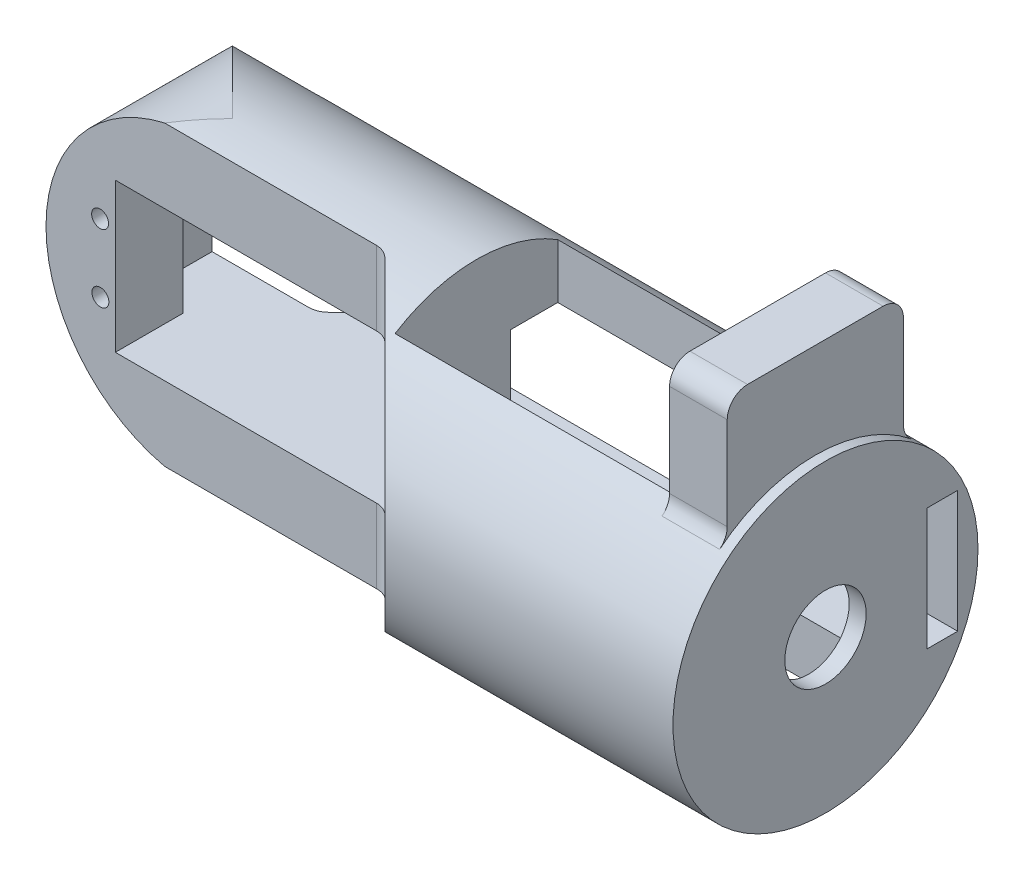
ISO-10303-21;
HEADER;
FILE_DESCRIPTION(('STEP AP214'),'2;1');
FILE_NAME('part.step','',(''),(''),'','','');
FILE_SCHEMA(('AUTOMOTIVE_DESIGN { 1 0 10303 214 1 1 1 1 }'));
ENDSEC;
DATA;
#1=APPLICATION_CONTEXT('core data for automotive mechanical design processes');
#2=APPLICATION_PROTOCOL_DEFINITION('international standard','automotive_design',2000,#1);
#3=PRODUCT_CONTEXT('',#1,'mechanical');
#4=PRODUCT('Part','Part','',(#3));
#5=PRODUCT_RELATED_PRODUCT_CATEGORY('part','',(#4));
#6=PRODUCT_DEFINITION_FORMATION('','',#4);
#7=PRODUCT_DEFINITION_CONTEXT('part definition',#1,'design');
#8=PRODUCT_DEFINITION('design','',#6,#7);
#9=PRODUCT_DEFINITION_SHAPE('','',#8);
#10=(LENGTH_UNIT() NAMED_UNIT(*) SI_UNIT(.MILLI.,.METRE.));
#11=(NAMED_UNIT(*) PLANE_ANGLE_UNIT() SI_UNIT($,.RADIAN.));
#12=(NAMED_UNIT(*) SI_UNIT($,.STERADIAN.) SOLID_ANGLE_UNIT());
#13=UNCERTAINTY_MEASURE_WITH_UNIT(LENGTH_MEASURE(1.E-05),#10,'distance_accuracy_value','');
#14=(GEOMETRIC_REPRESENTATION_CONTEXT(3) GLOBAL_UNCERTAINTY_ASSIGNED_CONTEXT((#13)) GLOBAL_UNIT_ASSIGNED_CONTEXT((#10,
#11,#12)) REPRESENTATION_CONTEXT('',''));
#15=CARTESIAN_POINT('',(0.,0.,0.));
#16=DIRECTION('',(0.,0.,1.));
#17=DIRECTION('',(1.,0.,0.));
#18=AXIS2_PLACEMENT_3D('',#15,#16,#17);
#19=CARTESIAN_POINT('',(0.,0.,-5.));
#20=DIRECTION('',(0.,0.,1.));
#21=DIRECTION('',(1.,0.,0.));
#22=AXIS2_PLACEMENT_3D('',#19,#20,#21);
#23=PLANE('',#22);
#24=CARTESIAN_POINT('',(-101.980307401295,-5.0567477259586,-5.));
#25=DIRECTION('',(0.,0.,-1.));
#26=DIRECTION('',(-1.,0.,0.));
#27=AXIS2_PLACEMENT_3D('',#24,#25,#26);
#28=CIRCLE('',#27,1.24999999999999);
#29=CARTESIAN_POINT('',(-103.230307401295,-5.0567477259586,-5.));
#30=VERTEX_POINT('',#29);
#31=EDGE_CURVE('E567',#30,#30,#28,.T.);
#32=ORIENTED_EDGE('',*,*,#31,.F.);
#33=EDGE_LOOP('',(#32));
#34=FACE_BOUND('',#33,.T.);
#35=CARTESIAN_POINT('',(-102.019470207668,4.94317558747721,-5.));
#36=DIRECTION('',(0.,0.,-1.));
#37=DIRECTION('',(-1.,0.,0.));
#38=AXIS2_PLACEMENT_3D('',#35,#36,#37);
#39=CIRCLE('',#38,1.24999999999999);
#40=CARTESIAN_POINT('',(-103.269470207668,4.94317558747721,-5.));
#41=VERTEX_POINT('',#40);
#42=EDGE_CURVE('E556',#41,#41,#39,.T.);
#43=ORIENTED_EDGE('',*,*,#42,.F.);
#44=EDGE_LOOP('',(#43));
#45=FACE_BOUND('',#44,.T.);
#46=DIRECTION('',(-1.,0.,0.));
#47=VECTOR('',#46,1.);
#48=CARTESIAN_POINT('',(-50.5,11.,-5.));
#49=LINE('',#48,#47);
#50=CARTESIAN_POINT('',(-99.7694702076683,11.,-5.));
#51=VERTEX_POINT('',#50);
#52=CARTESIAN_POINT('',(-105.5,11.,-5.));
#53=VERTEX_POINT('',#52);
#54=EDGE_CURVE('E342',#51,#53,#49,.T.);
#55=ORIENTED_EDGE('',*,*,#54,.F.);
#56=DIRECTION('',(0.,1.,0.));
#57=VECTOR('',#56,1.);
#58=CARTESIAN_POINT('',(-99.7694702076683,11.,-5.));
#59=LINE('',#58,#57);
#60=CARTESIAN_POINT('',(-99.7694702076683,-11.,-5.));
#61=VERTEX_POINT('',#60);
#62=EDGE_CURVE('E55',#61,#51,#59,.T.);
#63=ORIENTED_EDGE('',*,*,#62,.F.);
#64=DIRECTION('',(1.,0.,0.));
#65=VECTOR('',#64,1.);
#66=CARTESIAN_POINT('',(-50.5,-11.,-5.));
#67=LINE('',#66,#65);
#68=CARTESIAN_POINT('',(-105.5,-11.,-5.));
#69=VERTEX_POINT('',#68);
#70=EDGE_CURVE('E359',#69,#61,#67,.T.);
#71=ORIENTED_EDGE('',*,*,#70,.F.);
#72=DIRECTION('',(0.,-1.,0.));
#73=VECTOR('',#72,1.);
#74=CARTESIAN_POINT('',(-105.5,-11.,-5.));
#75=LINE('',#74,#73);
#76=EDGE_CURVE('E341',#53,#69,#75,.T.);
#77=ORIENTED_EDGE('',*,*,#76,.F.);
#78=EDGE_LOOP('',(#55,#63,#71,#77));
#79=FACE_BOUND('',#78,.T.);
#80=ADVANCED_FACE('F40',(#34,#45,#79),#23,.F.);
#81=CARTESIAN_POINT('',(-61.2426406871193,0.,8.));
#82=DIRECTION('',(0.,-1.,0.));
#83=DIRECTION('',(0.,0.,-1.));
#84=AXIS2_PLACEMENT_3D('',#81,#82,#83);
#85=CYLINDRICAL_SURFACE('',#84,3.);
#86=DIRECTION('',(0.,1.,0.));
#87=VECTOR('',#86,1.);
#88=CARTESIAN_POINT('',(-61.2426406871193,21.9374109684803,5.));
#89=LINE('',#88,#87);
#90=CARTESIAN_POINT('',(-61.2426406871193,11.,5.));
#91=VERTEX_POINT('',#90);
#92=CARTESIAN_POINT('',(-61.2426406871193,21.9374109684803,5.));
#93=VERTEX_POINT('',#92);
#94=EDGE_CURVE('E445',#91,#93,#89,.T.);
#95=ORIENTED_EDGE('',*,*,#94,.F.);
#96=CARTESIAN_POINT('',(-61.2426406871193,11.,8.));
#97=DIRECTION('',(0.,1.,0.));
#98=DIRECTION('',(-1.,0.,0.));
#99=AXIS2_PLACEMENT_3D('',#96,#97,#98);
#100=CIRCLE('',#99,3.);
#101=CARTESIAN_POINT('',(-59.1213203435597,11.,5.87867965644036));
#102=VERTEX_POINT('',#101);
#103=EDGE_CURVE('E12',#91,#102,#100,.F.);
#104=ORIENTED_EDGE('',*,*,#103,.T.);
#105=DIRECTION('',(0.,1.,0.));
#106=VECTOR('',#105,1.);
#107=CARTESIAN_POINT('',(-59.1213203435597,-21.9374109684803,5.87867965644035));
#108=LINE('',#107,#106);
#109=CARTESIAN_POINT('',(-59.1213203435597,21.718451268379,5.87867965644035));
#110=VERTEX_POINT('',#109);
#111=EDGE_CURVE('E450',#110,#102,#108,.F.);
#112=ORIENTED_EDGE('',*,*,#111,.F.);
#113=CARTESIAN_POINT('',(-61.2426406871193,21.9374109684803,5.));
#114=CARTESIAN_POINT('',(-61.1601246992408,21.9374095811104,4.99999081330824));
#115=CARTESIAN_POINT('',(-61.0776125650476,21.9366349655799,5.0034043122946));
#116=CARTESIAN_POINT('',(-60.913181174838,21.9335298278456,5.01700690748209));
#117=CARTESIAN_POINT('',(-60.83126189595,21.9311993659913,5.02719574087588));
#118=CARTESIAN_POINT('',(-60.6686069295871,21.9249735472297,5.054277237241));
#119=CARTESIAN_POINT('',(-60.5878710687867,21.9210784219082,5.07116890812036));
#120=CARTESIAN_POINT('',(-60.428170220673,21.9117088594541,5.11150064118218));
#121=CARTESIAN_POINT('',(-60.3492051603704,21.9062344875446,5.13494043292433));
#122=CARTESIAN_POINT('',(-60.115714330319,21.8874021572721,5.21485139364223));
#123=CARTESIAN_POINT('',(-59.9645482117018,21.8716333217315,5.28092166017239));
#124=CARTESIAN_POINT('',(-59.6759287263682,21.8335130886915,5.43636239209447));
#125=CARTESIAN_POINT('',(-59.5384545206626,21.8111719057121,5.52569667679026));
#126=CARTESIAN_POINT('',(-59.3587580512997,21.7753640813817,5.66437667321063));
#127=CARTESIAN_POINT('',(-59.3092214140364,21.764704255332,5.705222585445));
#128=CARTESIAN_POINT('',(-59.213069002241,21.74235439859,5.78981318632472));
#129=CARTESIAN_POINT('',(-59.1664489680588,21.7306659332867,5.83355344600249));
#130=CARTESIAN_POINT('',(-59.1213203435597,21.718451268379,5.87867965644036));
#131=B_SPLINE_CURVE_WITH_KNOTS('',3,(#113,#114,#115,#116,#117,#118,#119,#120,#121,#122,#123,
#124,#125,#126,#127,#128,#129,#130),.UNSPECIFIED.,.F.,.F.,(4,2,2,2,2,2,2,2,4),(0.,
0.247466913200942,0.494924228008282,0.74234493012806,0.989755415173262,1.48444205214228,
1.97836388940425,2.17350432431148,2.36835276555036),.UNSPECIFIED.);
#132=EDGE_CURVE('E453',#93,#110,#131,.T.);
#133=ORIENTED_EDGE('',*,*,#132,.F.);
#134=EDGE_LOOP('',(#95,#104,#112,#133));
#135=FACE_BOUND('',#134,.T.);
#136=ADVANCED_FACE('F473',(#135),#85,.F.);
#137=CARTESIAN_POINT('',(-110.,0.,0.));
#138=DIRECTION('',(1.,0.,0.));
#139=DIRECTION('',(0.,0.,-1.));
#140=AXIS2_PLACEMENT_3D('',#137,#138,#139);
#141=CYLINDRICAL_SURFACE('',#140,22.5);
#142=DIRECTION('',(1.,0.,0.));
#143=VECTOR('',#142,1.);
#144=CARTESIAN_POINT('',(-110.,-11.,-19.6277864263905));
#145=LINE('',#144,#143);
#146=CARTESIAN_POINT('',(-85.3722135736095,-11.,-19.6277864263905));
#147=VERTEX_POINT('',#146);
#148=CARTESIAN_POINT('',(-5.,-11.,-19.6277864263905));
#149=VERTEX_POINT('',#148);
#150=EDGE_CURVE('E367',#147,#149,#145,.T.);
#151=ORIENTED_EDGE('',*,*,#150,.T.);
#152=CARTESIAN_POINT('',(-5.,0.,0.));
#153=DIRECTION('',(1.,0.,0.));
#154=DIRECTION('',(0.,0.,-1.));
#155=AXIS2_PLACEMENT_3D('',#152,#153,#154);
#156=CIRCLE('',#155,22.5);
#157=CARTESIAN_POINT('',(-5.,11.,-19.6277864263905));
#158=VERTEX_POINT('',#157);
#159=EDGE_CURVE('E660',#158,#149,#156,.F.);
#160=ORIENTED_EDGE('',*,*,#159,.F.);
#161=DIRECTION('',(1.,0.,0.));
#162=VECTOR('',#161,1.);
#163=CARTESIAN_POINT('',(-110.,11.,-19.6277864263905));
#164=LINE('',#163,#162);
#165=CARTESIAN_POINT('',(-85.3722135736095,11.,-19.6277864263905));
#166=VERTEX_POINT('',#165);
#167=EDGE_CURVE('E358',#158,#166,#164,.F.);
#168=ORIENTED_EDGE('',*,*,#167,.T.);
#169=CARTESIAN_POINT('',(-105.,0.,0.));
#170=DIRECTION('',(0.707106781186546,0.,0.707106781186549));
#171=DIRECTION('',(0.707106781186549,0.,-0.707106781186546));
#172=AXIS2_PLACEMENT_3D('',#169,#170,#171);
#173=ELLIPSE('',#172,31.8198051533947,22.5);
#174=CARTESIAN_POINT('',(-89.1213203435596,15.9410643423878,-15.8786796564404));
#175=VERTEX_POINT('',#174);
#176=EDGE_CURVE('E374',#175,#166,#173,.F.);
#177=ORIENTED_EDGE('',*,*,#176,.F.);
#178=CARTESIAN_POINT('',(-89.1213203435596,15.9410643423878,-15.8786796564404));
#179=CARTESIAN_POINT('',(-89.1687599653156,15.9883060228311,-15.8312543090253));
#180=CARTESIAN_POINT('',(-89.2184266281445,16.0341940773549,-15.7847601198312));
#181=CARTESIAN_POINT('',(-89.3224036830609,16.1230064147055,-15.6940336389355));
#182=CARTESIAN_POINT('',(-89.3767192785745,16.1659272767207,-15.6498039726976));
#183=CARTESIAN_POINT('',(-89.5478557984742,16.2904974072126,-15.5204399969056));
#184=CARTESIAN_POINT('',(-89.6719506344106,16.367023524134,-15.4395704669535));
#185=CARTESIAN_POINT('',(-89.8718488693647,16.4691084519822,-15.3303951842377));
#186=CARTESIAN_POINT('',(-89.9411155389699,16.5011337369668,-15.295898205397));
#187=CARTESIAN_POINT('',(-90.0838086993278,16.5603656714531,-15.2317492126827));
#188=CARTESIAN_POINT('',(-90.1572324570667,16.5875754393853,-15.2020940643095));
#189=CARTESIAN_POINT('',(-90.3073100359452,16.6366007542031,-15.1484267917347));
#190=CARTESIAN_POINT('',(-90.3839417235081,16.6584478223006,-15.1243817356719));
#191=CARTESIAN_POINT('',(-90.5401352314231,16.6965656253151,-15.0822910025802));
#192=CARTESIAN_POINT('',(-90.6196953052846,16.7128396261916,-15.0642418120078));
#193=CARTESIAN_POINT('',(-90.7887736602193,16.7407961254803,-15.0331710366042));
#194=CARTESIAN_POINT('',(-90.8785139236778,16.7518867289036,-15.0207996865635));
#195=CARTESIAN_POINT('',(-91.014288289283,16.7630340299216,-15.0083549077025));
#196=CARTESIAN_POINT('',(-91.0598510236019,16.7658351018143,-15.0052252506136));
#197=CARTESIAN_POINT('',(-91.1511519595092,16.769573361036,-15.0010470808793));
#198=CARTESIAN_POINT('',(-91.1968901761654,16.7705103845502,-14.9999987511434));
#199=CARTESIAN_POINT('',(-91.2426406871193,16.7705098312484,-15.));
#200=B_SPLINE_CURVE_WITH_KNOTS('',3,(#178,#179,#180,#181,#182,#183,#184,#185,#186,#187,#188,
#189,#190,#191,#192,#193,#194,#195,#196,#197,#198,#199),.UNSPECIFIED.,.F.,.F.,(4,2,2,2,2,2,2,2,
2,2,4),(0.,0.246012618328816,0.492304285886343,0.989668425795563,1.24060634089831,
1.49138115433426,1.74064461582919,1.98976175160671,2.26283058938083,2.40002428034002,
2.53723002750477),.UNSPECIFIED.);
#201=CARTESIAN_POINT('',(-91.2426406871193,16.7705098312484,-15.));
#202=VERTEX_POINT('',#201);
#203=EDGE_CURVE('E487',#175,#202,#200,.T.);
#204=ORIENTED_EDGE('',*,*,#203,.T.);
#205=DIRECTION('',(1.,0.,0.));
#206=VECTOR('',#205,1.);
#207=CARTESIAN_POINT('',(-110.,16.7705098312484,-15.));
#208=LINE('',#207,#206);
#209=CARTESIAN_POINT('',(-102.5,16.7705098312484,-15.));
#210=VERTEX_POINT('',#209);
#211=EDGE_CURVE('E376',#210,#202,#208,.T.);
#212=ORIENTED_EDGE('',*,*,#211,.F.);
#213=CARTESIAN_POINT('',(-87.5,0.,0.));
#214=DIRECTION('',(0.707106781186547,0.,-0.707106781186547));
#215=DIRECTION('',(0.707106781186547,0.,0.707106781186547));
#216=AXIS2_PLACEMENT_3D('',#213,#214,#215);
#217=ELLIPSE('',#216,31.8198051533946,22.5);
#218=CARTESIAN_POINT('',(-87.5,22.5,0.));
#219=VERTEX_POINT('',#218);
#220=EDGE_CURVE('E390',#210,#219,#217,.T.);
#221=ORIENTED_EDGE('',*,*,#220,.T.);
#222=CARTESIAN_POINT('',(-87.5,0.,0.));
#223=DIRECTION('',(0.707106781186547,0.,0.707106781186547));
#224=DIRECTION('',(0.707106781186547,0.,-0.707106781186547));
#225=AXIS2_PLACEMENT_3D('',#222,#223,#224);
#226=ELLIPSE('',#225,31.8198051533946,22.5);
#227=CARTESIAN_POINT('',(-92.5,21.9374109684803,5.));
#228=VERTEX_POINT('',#227);
#229=EDGE_CURVE('E384',#219,#228,#226,.T.);
#230=ORIENTED_EDGE('',*,*,#229,.T.);
#231=DIRECTION('',(1.,0.,0.));
#232=VECTOR('',#231,1.);
#233=CARTESIAN_POINT('',(-110.,21.9374109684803,5.));
#234=LINE('',#233,#232);
#235=EDGE_CURVE('E394',#228,#93,#234,.T.);
#236=ORIENTED_EDGE('',*,*,#235,.T.);
#237=ORIENTED_EDGE('',*,*,#132,.T.);
#238=CARTESIAN_POINT('',(-65.,0.,0.));
#239=DIRECTION('',(-0.707106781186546,0.,0.707106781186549));
#240=DIRECTION('',(0.707106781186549,0.,0.707106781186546));
#241=AXIS2_PLACEMENT_3D('',#238,#239,#240);
#242=ELLIPSE('',#241,31.8198051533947,22.5);
#243=CARTESIAN_POINT('',(-59.1213203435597,-21.718451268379,5.87867965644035));
#244=VERTEX_POINT('',#243);
#245=EDGE_CURVE('E381',#110,#244,#242,.F.);
#246=ORIENTED_EDGE('',*,*,#245,.T.);
#247=CARTESIAN_POINT('',(-59.1213203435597,-21.718451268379,5.87867965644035));
#248=CARTESIAN_POINT('',(-59.1791106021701,-21.7340976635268,5.82087585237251));
#249=CARTESIAN_POINT('',(-59.2393930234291,-21.7488843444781,5.76533114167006));
#250=CARTESIAN_POINT('',(-59.3645355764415,-21.7767466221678,5.65917974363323));
#251=CARTESIAN_POINT('',(-59.4293960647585,-21.7898220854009,5.60857344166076));
#252=CARTESIAN_POINT('',(-59.5633414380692,-21.8142792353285,5.51268314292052));
#253=CARTESIAN_POINT('',(-59.6324302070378,-21.8256593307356,5.46740415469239));
#254=CARTESIAN_POINT('',(-59.7742735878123,-21.846725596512,5.38260942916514));
#255=CARTESIAN_POINT('',(-59.8470279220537,-21.8564118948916,5.3430932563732));
#256=CARTESIAN_POINT('',(-60.0702262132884,-21.8829826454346,5.23361807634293));
#257=CARTESIAN_POINT('',(-60.2255654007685,-21.8973717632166,5.1727611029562));
#258=CARTESIAN_POINT('',(-60.5443087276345,-21.9196154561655,5.07768429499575));
#259=CARTESIAN_POINT('',(-60.7076954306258,-21.9274835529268,5.04340935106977));
#260=CARTESIAN_POINT('',(-60.9340706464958,-21.9339264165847,5.01526740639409));
#261=CARTESIAN_POINT('',(-60.9956759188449,-21.935234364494,5.00954161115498));
#262=CARTESIAN_POINT('',(-61.119059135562,-21.9369756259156,5.00191136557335));
#263=CARTESIAN_POINT('',(-61.1808367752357,-21.9374100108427,5.00000223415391));
#264=CARTESIAN_POINT('',(-61.2426406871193,-21.9374109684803,5.));
#265=B_SPLINE_CURVE_WITH_KNOTS('',3,(#247,#248,#249,#250,#251,#252,#253,#254,#255,#256,#257,
#258,#259,#260,#261,#262,#263,#264),.UNSPECIFIED.,.F.,.F.,(4,2,2,2,2,2,2,2,4),(0.,
0.249591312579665,0.499202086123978,0.749045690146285,0.998870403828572,1.49866729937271,
1.99742523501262,2.1829812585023,2.36830956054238),.UNSPECIFIED.);
#266=CARTESIAN_POINT('',(-61.2426406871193,-21.9374109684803,5.));
#267=VERTEX_POINT('',#266);
#268=EDGE_CURVE('E460',#244,#267,#265,.T.);
#269=ORIENTED_EDGE('',*,*,#268,.T.);
#270=DIRECTION('',(1.,0.,0.));
#271=VECTOR('',#270,1.);
#272=CARTESIAN_POINT('',(-110.,-21.9374109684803,5.));
#273=LINE('',#272,#271);
#274=CARTESIAN_POINT('',(-92.5,-21.9374109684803,5.));
#275=VERTEX_POINT('',#274);
#276=EDGE_CURVE('E397',#267,#275,#273,.F.);
#277=ORIENTED_EDGE('',*,*,#276,.T.);
#278=CARTESIAN_POINT('',(-87.5,0.,0.));
#279=DIRECTION('',(0.707106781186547,0.,0.707106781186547));
#280=DIRECTION('',(0.707106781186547,0.,-0.707106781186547));
#281=AXIS2_PLACEMENT_3D('',#278,#279,#280);
#282=ELLIPSE('',#281,31.8198051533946,22.5);
#283=CARTESIAN_POINT('',(-87.5,-22.5,0.));
#284=VERTEX_POINT('',#283);
#285=EDGE_CURVE('E387',#275,#284,#282,.T.);
#286=ORIENTED_EDGE('',*,*,#285,.T.);
#287=CARTESIAN_POINT('',(-102.5,-16.7705098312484,-15.));
#288=VERTEX_POINT('',#287);
#289=EDGE_CURVE('E391',#284,#288,#217,.T.);
#290=ORIENTED_EDGE('',*,*,#289,.T.);
#291=DIRECTION('',(1.,0.,0.));
#292=VECTOR('',#291,1.);
#293=CARTESIAN_POINT('',(-110.,-16.7705098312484,-15.));
#294=LINE('',#293,#292);
#295=CARTESIAN_POINT('',(-91.2426406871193,-16.7705098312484,-15.));
#296=VERTEX_POINT('',#295);
#297=EDGE_CURVE('E379',#296,#288,#294,.F.);
#298=ORIENTED_EDGE('',*,*,#297,.F.);
#299=CARTESIAN_POINT('',(-91.2426406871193,-16.7705098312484,-15.));
#300=CARTESIAN_POINT('',(-91.1741709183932,-16.7705199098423,-14.9999846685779));
#301=CARTESIAN_POINT('',(-91.1057103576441,-16.7684135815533,-15.0023435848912));
#302=CARTESIAN_POINT('',(-90.9693965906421,-16.7600460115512,-15.0116930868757));
#303=CARTESIAN_POINT('',(-90.9015430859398,-16.7537869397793,-15.0186812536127));
#304=CARTESIAN_POINT('',(-90.7676162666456,-16.7372725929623,-15.0370824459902));
#305=CARTESIAN_POINT('',(-90.7015320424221,-16.7270569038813,-15.0484516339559));
#306=CARTESIAN_POINT('',(-90.5709633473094,-16.7027758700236,-15.0753974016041));
#307=CARTESIAN_POINT('',(-90.5064789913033,-16.68871024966,-15.0909742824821));
#308=CARTESIAN_POINT('',(-90.3162886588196,-16.6410355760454,-15.1435856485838));
#309=CARTESIAN_POINT('',(-90.193518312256,-16.6019073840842,-15.1865475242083));
#310=CARTESIAN_POINT('',(-89.9582352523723,-16.5105437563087,-15.2858265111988));
#311=CARTESIAN_POINT('',(-89.8457704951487,-16.4582509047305,-15.3422020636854));
#312=CARTESIAN_POINT('',(-89.6204896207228,-16.335722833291,-15.4726543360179));
#313=CARTESIAN_POINT('',(-89.5091800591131,-16.2641024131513,-15.5480317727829));
#314=CARTESIAN_POINT('',(-89.3545306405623,-16.1484956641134,-15.6677746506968));
#315=CARTESIAN_POINT('',(-89.3051607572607,-16.1087263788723,-15.7086716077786));
#316=CARTESIAN_POINT('',(-89.2103397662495,-16.0267037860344,-15.7923462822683));
#317=CARTESIAN_POINT('',(-89.164884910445,-15.9844529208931,-15.8351221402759));
#318=CARTESIAN_POINT('',(-89.1213203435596,-15.9410643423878,-15.8786796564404));
#319=B_SPLINE_CURVE_WITH_KNOTS('',3,(#299,#300,#301,#302,#303,#304,#305,#306,#307,#308,#309,
#310,#311,#312,#313,#314,#315,#316,#317,#318),.UNSPECIFIED.,.F.,.F.,(4,2,2,2,2,2,2,2,2,4),(0.,
0.205321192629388,0.410535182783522,0.613746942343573,0.816973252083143,1.22244007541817,
1.62970688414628,2.08475132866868,2.3109455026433,2.53692066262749),.UNSPECIFIED.);
#320=CARTESIAN_POINT('',(-89.1213203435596,-15.9410643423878,-15.8786796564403));
#321=VERTEX_POINT('',#320);
#322=EDGE_CURVE('E482',#296,#321,#319,.T.);
#323=ORIENTED_EDGE('',*,*,#322,.T.);
#324=EDGE_CURVE('E373',#147,#321,#173,.F.);
#325=ORIENTED_EDGE('',*,*,#324,.F.);
#326=EDGE_LOOP('',(#151,#160,#168,#177,#204,#212,#221,#230,#236,#237,#246,#269,#277,#286,#290,
#298,#323,#325));
#327=FACE_BOUND('',#326,.T.);
#328=CARTESIAN_POINT('',(-2.5,0.,0.));
#329=DIRECTION('',(1.,0.,0.));
#330=DIRECTION('',(0.,0.,-1.));
#331=AXIS2_PLACEMENT_3D('',#328,#329,#330);
#332=CIRCLE('',#331,22.5);
#333=CARTESIAN_POINT('',(-2.5,-19.0328663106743,-12.));
#334=VERTEX_POINT('',#333);
#335=CARTESIAN_POINT('',(-2.5,-19.0328663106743,12.));
#336=VERTEX_POINT('',#335);
#337=EDGE_CURVE('E413',#334,#336,#332,.F.);
#338=ORIENTED_EDGE('',*,*,#337,.F.);
#339=DIRECTION('',(1.,0.,0.));
#340=VECTOR('',#339,1.);
#341=CARTESIAN_POINT('',(-110.,-19.0328663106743,-12.));
#342=LINE('',#341,#340);
#343=CARTESIAN_POINT('',(-51.5,-19.0328663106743,-12.));
#344=VERTEX_POINT('',#343);
#345=EDGE_CURVE('E427',#344,#334,#342,.T.);
#346=ORIENTED_EDGE('',*,*,#345,.F.);
#347=CARTESIAN_POINT('',(-51.5,0.,0.));
#348=DIRECTION('',(-1.,0.,0.));
#349=DIRECTION('',(0.,0.,1.));
#350=AXIS2_PLACEMENT_3D('',#347,#348,#349);
#351=CIRCLE('',#350,22.5);
#352=CARTESIAN_POINT('',(-51.5,-19.0328663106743,12.));
#353=VERTEX_POINT('',#352);
#354=EDGE_CURVE('E416',#353,#344,#351,.F.);
#355=ORIENTED_EDGE('',*,*,#354,.F.);
#356=DIRECTION('',(1.,0.,0.));
#357=VECTOR('',#356,1.);
#358=CARTESIAN_POINT('',(-110.,-19.0328663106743,12.));
#359=LINE('',#358,#357);
#360=EDGE_CURVE('E424',#336,#353,#359,.F.);
#361=ORIENTED_EDGE('',*,*,#360,.F.);
#362=EDGE_LOOP('',(#338,#346,#355,#361));
#363=FACE_BOUND('',#362,.T.);
#364=CARTESIAN_POINT('',(0.,0.,0.));
#365=DIRECTION('',(1.,0.,0.));
#366=DIRECTION('',(0.,0.,-1.));
#367=AXIS2_PLACEMENT_3D('',#364,#365,#366);
#368=CIRCLE('',#367,22.5);
#369=CARTESIAN_POINT('',(0.,0.,-22.5));
#370=VERTEX_POINT('',#369);
#371=EDGE_CURVE('E403',#370,#370,#368,.T.);
#372=ORIENTED_EDGE('',*,*,#371,.F.);
#373=EDGE_LOOP('',(#372));
#374=FACE_BOUND('',#373,.T.);
#375=CARTESIAN_POINT('',(-10.,0.,0.));
#376=DIRECTION('',(1.,0.,0.));
#377=DIRECTION('',(0.,0.,-1.));
#378=AXIS2_PLACEMENT_3D('',#375,#376,#377);
#379=CIRCLE('',#378,22.5);
#380=CARTESIAN_POINT('',(-9.99999999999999,17.5197614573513,-14.1176470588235));
#381=VERTEX_POINT('',#380);
#382=CARTESIAN_POINT('',(-9.99999999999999,19.0328663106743,-12.));
#383=VERTEX_POINT('',#382);
#384=EDGE_CURVE('E604',#381,#383,#379,.T.);
#385=ORIENTED_EDGE('',*,*,#384,.F.);
#386=DIRECTION('',(1.,0.,0.));
#387=VECTOR('',#386,1.);
#388=CARTESIAN_POINT('',(-110.,17.5197614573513,-14.1176470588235));
#389=LINE('',#388,#387);
#390=CARTESIAN_POINT('',(-1.5,17.5197614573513,-14.1176470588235));
#391=VERTEX_POINT('',#390);
#392=EDGE_CURVE('E1166',#381,#391,#389,.T.);
#393=ORIENTED_EDGE('',*,*,#392,.T.);
#394=CARTESIAN_POINT('',(-1.5,0.,0.));
#395=DIRECTION('',(-1.,0.,0.));
#396=DIRECTION('',(0.,0.,-1.));
#397=AXIS2_PLACEMENT_3D('',#394,#395,#396);
#398=CIRCLE('',#397,22.5);
#399=CARTESIAN_POINT('',(-1.5,17.5197614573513,14.1176470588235));
#400=VERTEX_POINT('',#399);
#401=EDGE_CURVE('E585',#400,#391,#398,.T.);
#402=ORIENTED_EDGE('',*,*,#401,.F.);
#403=DIRECTION('',(1.,0.,0.));
#404=VECTOR('',#403,1.);
#405=CARTESIAN_POINT('',(-110.,17.5197614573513,14.1176470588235));
#406=LINE('',#405,#404);
#407=CARTESIAN_POINT('',(-10.,17.5197614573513,14.1176470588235));
#408=VERTEX_POINT('',#407);
#409=EDGE_CURVE('E1163',#400,#408,#406,.F.);
#410=ORIENTED_EDGE('',*,*,#409,.T.);
#411=CARTESIAN_POINT('',(-10.,0.,0.));
#412=DIRECTION('',(1.,0.,0.));
#413=DIRECTION('',(0.,0.,-1.));
#414=AXIS2_PLACEMENT_3D('',#411,#412,#413);
#415=CIRCLE('',#414,22.5);
#416=CARTESIAN_POINT('',(-10.,19.0328663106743,12.));
#417=VERTEX_POINT('',#416);
#418=EDGE_CURVE('E590',#417,#408,#415,.T.);
#419=ORIENTED_EDGE('',*,*,#418,.F.);
#420=DIRECTION('',(1.,0.,0.));
#421=VECTOR('',#420,1.);
#422=CARTESIAN_POINT('',(-110.,19.0328663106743,12.));
#423=LINE('',#422,#421);
#424=CARTESIAN_POINT('',(-51.5,19.0328663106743,12.));
#425=VERTEX_POINT('',#424);
#426=EDGE_CURVE('E417',#425,#417,#423,.T.);
#427=ORIENTED_EDGE('',*,*,#426,.F.);
#428=CARTESIAN_POINT('',(-51.5,19.0328663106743,-12.));
#429=VERTEX_POINT('',#428);
#430=EDGE_CURVE('E419',#429,#425,#351,.F.);
#431=ORIENTED_EDGE('',*,*,#430,.F.);
#432=DIRECTION('',(1.,0.,0.));
#433=VECTOR('',#432,1.);
#434=CARTESIAN_POINT('',(-110.,19.0328663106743,-12.));
#435=LINE('',#434,#433);
#436=EDGE_CURVE('E412',#383,#429,#435,.F.);
#437=ORIENTED_EDGE('',*,*,#436,.F.);
#438=EDGE_LOOP('',(#385,#393,#402,#410,#419,#427,#431,#437));
#439=FACE_BOUND('',#438,.T.);
#440=ADVANCED_FACE('F468',(#327,#363,#374,#439),#141,.T.);
#441=CARTESIAN_POINT('',(-51.5,-22.5,12.));
#442=DIRECTION('',(-1.,0.,0.));
#443=DIRECTION('',(0.,0.,1.));
#444=AXIS2_PLACEMENT_3D('',#441,#442,#443);
#445=PLANE('',#444);
#446=DIRECTION('',(0.,0.,-1.));
#447=VECTOR('',#446,1.);
#448=CARTESIAN_POINT('',(-51.5,-11.,12.));
#449=LINE('',#448,#447);
#450=CARTESIAN_POINT('',(-51.5,-11.,-5.));
#451=VERTEX_POINT('',#450);
#452=CARTESIAN_POINT('',(-51.5,-11.,-12.));
#453=VERTEX_POINT('',#452);
#454=EDGE_CURVE('E371',#451,#453,#449,.T.);
#455=ORIENTED_EDGE('',*,*,#454,.F.);
#456=DIRECTION('',(0.,1.,0.));
#457=VECTOR('',#456,1.);
#458=CARTESIAN_POINT('',(-51.5,-22.5,-5.));
#459=LINE('',#458,#457);
#460=CARTESIAN_POINT('',(-51.5,11.,-5.));
#461=VERTEX_POINT('',#460);
#462=EDGE_CURVE('E443',#451,#461,#459,.T.);
#463=ORIENTED_EDGE('',*,*,#462,.T.);
#464=DIRECTION('',(0.,0.,1.));
#465=VECTOR('',#464,1.);
#466=CARTESIAN_POINT('',(-51.5,11.,12.));
#467=LINE('',#466,#465);
#468=CARTESIAN_POINT('',(-51.5,11.,-12.));
#469=VERTEX_POINT('',#468);
#470=EDGE_CURVE('E340',#469,#461,#467,.T.);
#471=ORIENTED_EDGE('',*,*,#470,.F.);
#472=DIRECTION('',(0.,1.,0.));
#473=VECTOR('',#472,1.);
#474=CARTESIAN_POINT('',(-51.5,-22.5,-12.));
#475=LINE('',#474,#473);
#476=EDGE_CURVE('E404',#469,#429,#475,.T.);
#477=ORIENTED_EDGE('',*,*,#476,.T.);
#478=ORIENTED_EDGE('',*,*,#430,.T.);
#479=DIRECTION('',(0.,1.,0.));
#480=VECTOR('',#479,1.);
#481=CARTESIAN_POINT('',(-51.5,-22.5,12.));
#482=LINE('',#481,#480);
#483=EDGE_CURVE('E399',#353,#425,#482,.T.);
#484=ORIENTED_EDGE('',*,*,#483,.F.);
#485=ORIENTED_EDGE('',*,*,#354,.T.);
#486=EDGE_CURVE('E400',#344,#453,#475,.T.);
#487=ORIENTED_EDGE('',*,*,#486,.T.);
#488=EDGE_LOOP('',(#455,#463,#471,#477,#478,#484,#485,#487));
#489=FACE_BOUND('',#488,.T.);
#490=ADVANCED_FACE('F472',(#489),#445,.F.);
#491=CARTESIAN_POINT('',(-2.5,-22.5,-12.));
#492=DIRECTION('',(0.,0.,-1.));
#493=DIRECTION('',(-1.,0.,0.));
#494=AXIS2_PLACEMENT_3D('',#491,#492,#493);
#495=PLANE('',#494);
#496=DIRECTION('',(0.,1.,0.));
#497=VECTOR('',#496,1.);
#498=CARTESIAN_POINT('',(-5.,-11.,-12.));
#499=LINE('',#498,#497);
#500=CARTESIAN_POINT('',(-5.,-11.,-12.));
#501=VERTEX_POINT('',#500);
#502=CARTESIAN_POINT('',(-5.,11.,-12.));
#503=VERTEX_POINT('',#502);
#504=EDGE_CURVE('E654',#501,#503,#499,.T.);
#505=ORIENTED_EDGE('',*,*,#504,.F.);
#506=DIRECTION('',(1.,0.,0.));
#507=VECTOR('',#506,1.);
#508=CARTESIAN_POINT('',(-2.5,-11.,-12.));
#509=LINE('',#508,#507);
#510=EDGE_CURVE('E369',#453,#501,#509,.T.);
#511=ORIENTED_EDGE('',*,*,#510,.F.);
#512=ORIENTED_EDGE('',*,*,#486,.F.);
#513=ORIENTED_EDGE('',*,*,#345,.T.);
#514=DIRECTION('',(0.,1.,0.));
#515=VECTOR('',#514,1.);
#516=CARTESIAN_POINT('',(-2.5,-22.5,-12.));
#517=LINE('',#516,#515);
#518=CARTESIAN_POINT('',(-2.5,30.0328663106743,-12.));
#519=VERTEX_POINT('',#518);
#520=EDGE_CURVE('E405',#334,#519,#517,.T.);
#521=ORIENTED_EDGE('',*,*,#520,.T.);
#522=DIRECTION('',(-1.,0.,0.));
#523=VECTOR('',#522,1.);
#524=CARTESIAN_POINT('',(-2.5,30.0328663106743,-12.));
#525=LINE('',#524,#523);
#526=CARTESIAN_POINT('',(-10.,30.0328663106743,-12.));
#527=VERTEX_POINT('',#526);
#528=EDGE_CURVE('E594',#519,#527,#525,.T.);
#529=ORIENTED_EDGE('',*,*,#528,.T.);
#530=DIRECTION('',(0.,-1.,0.));
#531=VECTOR('',#530,1.);
#532=CARTESIAN_POINT('',(-10.,0.,-12.));
#533=LINE('',#532,#531);
#534=EDGE_CURVE('E601',#527,#383,#533,.T.);
#535=ORIENTED_EDGE('',*,*,#534,.T.);
#536=ORIENTED_EDGE('',*,*,#436,.T.);
#537=ORIENTED_EDGE('',*,*,#476,.F.);
#538=DIRECTION('',(-1.,0.,0.));
#539=VECTOR('',#538,1.);
#540=CARTESIAN_POINT('',(-2.50000000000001,11.,-12.));
#541=LINE('',#540,#539);
#542=EDGE_CURVE('E362',#503,#469,#541,.T.);
#543=ORIENTED_EDGE('',*,*,#542,.F.);
#544=EDGE_LOOP('',(#505,#511,#512,#513,#521,#529,#535,#536,#537,#543));
#545=FACE_BOUND('',#544,.T.);
#546=ADVANCED_FACE('F627',(#545),#495,.F.);
#547=CARTESIAN_POINT('',(0.,0.,-15.));
#548=DIRECTION('',(0.,0.,1.));
#549=DIRECTION('',(1.,0.,0.));
#550=AXIS2_PLACEMENT_3D('',#547,#548,#549);
#551=PLANE('',#550);
#552=DIRECTION('',(-1.,0.,0.));
#553=VECTOR('',#552,1.);
#554=CARTESIAN_POINT('',(0.,-11.,-15.));
#555=LINE('',#554,#553);
#556=CARTESIAN_POINT('',(-91.2426406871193,-11.,-15.));
#557=VERTEX_POINT('',#556);
#558=CARTESIAN_POINT('',(-105.5,-11.,-15.));
#559=VERTEX_POINT('',#558);
#560=EDGE_CURVE('E365',#557,#559,#555,.T.);
#561=ORIENTED_EDGE('',*,*,#560,.F.);
#562=DIRECTION('',(0.,1.,0.));
#563=VECTOR('',#562,1.);
#564=CARTESIAN_POINT('',(-91.2426406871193,-16.7705098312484,-15.));
#565=LINE('',#564,#563);
#566=EDGE_CURVE('E1134',#557,#296,#565,.F.);
#567=ORIENTED_EDGE('',*,*,#566,.T.);
#568=ORIENTED_EDGE('',*,*,#297,.T.);
#569=CARTESIAN_POINT('',(-87.5,0.,-15.));
#570=DIRECTION('',(0.,0.,1.));
#571=DIRECTION('',(1.,0.,0.));
#572=AXIS2_PLACEMENT_3D('',#569,#570,#571);
#573=CIRCLE('',#572,22.5);
#574=EDGE_CURVE('E433',#288,#210,#573,.F.);
#575=ORIENTED_EDGE('',*,*,#574,.T.);
#576=ORIENTED_EDGE('',*,*,#211,.T.);
#577=DIRECTION('',(0.,1.,0.));
#578=VECTOR('',#577,1.);
#579=CARTESIAN_POINT('',(-91.2426406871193,11.,-15.));
#580=LINE('',#579,#578);
#581=CARTESIAN_POINT('',(-91.2426406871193,11.,-15.));
#582=VERTEX_POINT('',#581);
#583=EDGE_CURVE('E1133',#202,#582,#580,.F.);
#584=ORIENTED_EDGE('',*,*,#583,.T.);
#585=DIRECTION('',(1.,0.,0.));
#586=VECTOR('',#585,1.);
#587=CARTESIAN_POINT('',(0.,11.,-15.));
#588=LINE('',#587,#586);
#589=CARTESIAN_POINT('',(-105.5,11.,-15.));
#590=VERTEX_POINT('',#589);
#591=EDGE_CURVE('E355',#590,#582,#588,.T.);
#592=ORIENTED_EDGE('',*,*,#591,.F.);
#593=DIRECTION('',(0.,1.,0.));
#594=VECTOR('',#593,1.);
#595=CARTESIAN_POINT('',(-105.5,0.,-15.));
#596=LINE('',#595,#594);
#597=EDGE_CURVE('E441',#559,#590,#596,.T.);
#598=ORIENTED_EDGE('',*,*,#597,.F.);
#599=EDGE_LOOP('',(#561,#567,#568,#575,#576,#584,#592,#598));
#600=FACE_BOUND('',#599,.T.);
#601=ADVANCED_FACE('F976',(#600),#551,.F.);
#602=CARTESIAN_POINT('',(-75.857864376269,-16.7705098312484,-29.1421356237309));
#603=DIRECTION('',(0.707106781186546,0.,0.707106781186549));
#604=DIRECTION('',(0.707106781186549,0.,-0.707106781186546));
#605=AXIS2_PLACEMENT_3D('',#602,#603,#604);
#606=PLANE('',#605);
#607=ORIENTED_EDGE('',*,*,#324,.T.);
#608=DIRECTION('',(0.,1.,0.));
#609=VECTOR('',#608,1.);
#610=CARTESIAN_POINT('',(-89.1213203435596,-11.,-15.8786796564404));
#611=LINE('',#610,#609);
#612=CARTESIAN_POINT('',(-89.1213203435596,-11.,-15.8786796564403));
#613=VERTEX_POINT('',#612);
#614=EDGE_CURVE('E1131',#321,#613,#611,.T.);
#615=ORIENTED_EDGE('',*,*,#614,.T.);
#616=DIRECTION('',(-0.707106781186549,0.,0.707106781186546));
#617=VECTOR('',#616,1.);
#618=CARTESIAN_POINT('',(-75.857864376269,-11.,-29.1421356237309));
#619=LINE('',#618,#617);
#620=EDGE_CURVE('E438',#147,#613,#619,.T.);
#621=ORIENTED_EDGE('',*,*,#620,.F.);
#622=EDGE_LOOP('',(#607,#615,#621));
#623=FACE_BOUND('',#622,.T.);
#624=ADVANCED_FACE('F1129',(#623),#606,.F.);
#625=DIRECTION('',(0.707106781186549,0.,-0.707106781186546));
#626=VECTOR('',#625,1.);
#627=CARTESIAN_POINT('',(-75.857864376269,11.,-29.1421356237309));
#628=LINE('',#627,#626);
#629=CARTESIAN_POINT('',(-89.1213203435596,11.,-15.8786796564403));
#630=VERTEX_POINT('',#629);
#631=EDGE_CURVE('E435',#630,#166,#628,.T.);
#632=ORIENTED_EDGE('',*,*,#631,.F.);
#633=DIRECTION('',(0.,1.,0.));
#634=VECTOR('',#633,1.);
#635=CARTESIAN_POINT('',(-89.1213203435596,16.7705098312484,-15.8786796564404));
#636=LINE('',#635,#634);
#637=EDGE_CURVE('E1137',#630,#175,#636,.T.);
#638=ORIENTED_EDGE('',*,*,#637,.T.);
#639=ORIENTED_EDGE('',*,*,#176,.T.);
#640=EDGE_LOOP('',(#632,#638,#639));
#641=FACE_BOUND('',#640,.T.);
#642=ADVANCED_FACE('F1243',(#641),#606,.F.);
#643=CARTESIAN_POINT('',(0.,0.,5.));
#644=DIRECTION('',(0.,0.,1.));
#645=DIRECTION('',(1.,0.,0.));
#646=AXIS2_PLACEMENT_3D('',#643,#644,#645);
#647=PLANE('',#646);
#648=DIRECTION('',(-1.,0.,0.));
#649=VECTOR('',#648,1.);
#650=CARTESIAN_POINT('',(0.,11.,5.));
#651=LINE('',#650,#649);
#652=CARTESIAN_POINT('',(-99.7694702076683,11.,5.));
#653=VERTEX_POINT('',#652);
#654=EDGE_CURVE('E1118',#91,#653,#651,.T.);
#655=ORIENTED_EDGE('',*,*,#654,.F.);
#656=ORIENTED_EDGE('',*,*,#94,.T.);
#657=ORIENTED_EDGE('',*,*,#235,.F.);
#658=CARTESIAN_POINT('',(-87.5,0.,5.));
#659=DIRECTION('',(0.,0.,1.));
#660=DIRECTION('',(1.,0.,0.));
#661=AXIS2_PLACEMENT_3D('',#658,#659,#660);
#662=CIRCLE('',#661,22.5);
#663=EDGE_CURVE('E430',#228,#275,#662,.T.);
#664=ORIENTED_EDGE('',*,*,#663,.T.);
#665=ORIENTED_EDGE('',*,*,#276,.F.);
#666=CARTESIAN_POINT('',(-61.2426406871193,-11.,5.));
#667=VERTEX_POINT('',#666);
#668=EDGE_CURVE('E446',#267,#667,#89,.T.);
#669=ORIENTED_EDGE('',*,*,#668,.T.);
#670=DIRECTION('',(1.,0.,0.));
#671=VECTOR('',#670,1.);
#672=CARTESIAN_POINT('',(0.,-11.,5.));
#673=LINE('',#672,#671);
#674=CARTESIAN_POINT('',(-99.7694702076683,-11.,5.));
#675=VERTEX_POINT('',#674);
#676=EDGE_CURVE('E63',#675,#667,#673,.T.);
#677=ORIENTED_EDGE('',*,*,#676,.F.);
#678=DIRECTION('',(0.,-1.,0.));
#679=VECTOR('',#678,1.);
#680=CARTESIAN_POINT('',(-99.7694702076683,0.,5.));
#681=LINE('',#680,#679);
#682=EDGE_CURVE('E668',#653,#675,#681,.T.);
#683=ORIENTED_EDGE('',*,*,#682,.F.);
#684=EDGE_LOOP('',(#655,#656,#657,#664,#665,#669,#677,#683));
#685=FACE_BOUND('',#684,.T.);
#686=CARTESIAN_POINT('',(-102.019470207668,4.94317558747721,5.));
#687=DIRECTION('',(0.,0.,1.));
#688=DIRECTION('',(1.,0.,0.));
#689=AXIS2_PLACEMENT_3D('',#686,#687,#688);
#690=CIRCLE('',#689,1.24999999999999);
#691=CARTESIAN_POINT('',(-100.769470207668,4.94317558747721,5.));
#692=VERTEX_POINT('',#691);
#693=EDGE_CURVE('E564',#692,#692,#690,.T.);
#694=ORIENTED_EDGE('',*,*,#693,.F.);
#695=EDGE_LOOP('',(#694));
#696=FACE_BOUND('',#695,.T.);
#697=CARTESIAN_POINT('',(-101.980307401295,-5.0567477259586,5.));
#698=DIRECTION('',(0.,0.,1.));
#699=DIRECTION('',(1.,0.,0.));
#700=AXIS2_PLACEMENT_3D('',#697,#698,#699);
#701=CIRCLE('',#700,1.24999999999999);
#702=CARTESIAN_POINT('',(-100.730307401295,-5.0567477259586,5.));
#703=VERTEX_POINT('',#702);
#704=EDGE_CURVE('E570',#703,#703,#701,.T.);
#705=ORIENTED_EDGE('',*,*,#704,.F.);
#706=EDGE_LOOP('',(#705));
#707=FACE_BOUND('',#706,.T.);
#708=ADVANCED_FACE('F941',(#685,#696,#707),#647,.T.);
#709=CARTESIAN_POINT('',(0.,0.,0.));
#710=DIRECTION('',(1.,0.,0.));
#711=DIRECTION('',(0.,0.,-1.));
#712=AXIS2_PLACEMENT_3D('',#709,#710,#711);
#713=PLANE('',#712);
#714=DIRECTION('',(0.,-1.,0.));
#715=VECTOR('',#714,1.);
#716=CARTESIAN_POINT('',(0.,0.,-15.));
#717=LINE('',#716,#715);
#718=CARTESIAN_POINT('',(0.,9.00000000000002,-15.));
#719=VERTEX_POINT('',#718);
#720=CARTESIAN_POINT('',(0.,-8.99999999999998,-15.));
#721=VERTEX_POINT('',#720);
#722=EDGE_CURVE('E700',#719,#721,#717,.T.);
#723=ORIENTED_EDGE('',*,*,#722,.F.);
#724=DIRECTION('',(0.,0.,1.));
#725=VECTOR('',#724,1.);
#726=CARTESIAN_POINT('',(0.,9.00000000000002,0.));
#727=LINE('',#726,#725);
#728=CARTESIAN_POINT('',(0.,9.00000000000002,-19.5));
#729=VERTEX_POINT('',#728);
#730=EDGE_CURVE('E685',#729,#719,#727,.T.);
#731=ORIENTED_EDGE('',*,*,#730,.F.);
#732=DIRECTION('',(0.,1.,0.));
#733=VECTOR('',#732,1.);
#734=CARTESIAN_POINT('',(0.,0.,-19.5));
#735=LINE('',#734,#733);
#736=CARTESIAN_POINT('',(0.,-8.99999999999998,-19.5));
#737=VERTEX_POINT('',#736);
#738=EDGE_CURVE('E695',#737,#729,#735,.T.);
#739=ORIENTED_EDGE('',*,*,#738,.F.);
#740=DIRECTION('',(0.,0.,-1.));
#741=VECTOR('',#740,1.);
#742=CARTESIAN_POINT('',(0.,-8.99999999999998,0.));
#743=LINE('',#742,#741);
#744=EDGE_CURVE('E698',#721,#737,#743,.T.);
#745=ORIENTED_EDGE('',*,*,#744,.F.);
#746=EDGE_LOOP('',(#723,#731,#739,#745));
#747=FACE_BOUND('',#746,.T.);
#748=CARTESIAN_POINT('',(0.,0.,0.));
#749=DIRECTION('',(1.,0.,0.));
#750=DIRECTION('',(0.,0.,-1.));
#751=AXIS2_PLACEMENT_3D('',#748,#749,#750);
#752=CIRCLE('',#751,6.);
#753=CARTESIAN_POINT('',(0.,0.,-6.));
#754=VERTEX_POINT('',#753);
#755=EDGE_CURVE('E573',#754,#754,#752,.T.);
#756=ORIENTED_EDGE('',*,*,#755,.F.);
#757=EDGE_LOOP('',(#756));
#758=FACE_BOUND('',#757,.T.);
#759=ORIENTED_EDGE('',*,*,#371,.T.);
#760=EDGE_LOOP('',(#759));
#761=FACE_BOUND('',#760,.T.);
#762=ADVANCED_FACE('F475',(#747,#758,#761),#713,.T.);
#763=CARTESIAN_POINT('',(-2.5,-22.5,12.));
#764=DIRECTION('',(1.,0.,0.));
#765=DIRECTION('',(0.,0.,-1.));
#766=AXIS2_PLACEMENT_3D('',#763,#764,#765);
#767=PLANE('',#766);
#768=CARTESIAN_POINT('',(-2.5,-14.5,-5.));
#769=DIRECTION('',(-1.,0.,0.));
#770=DIRECTION('',(0.,0.,1.));
#771=AXIS2_PLACEMENT_3D('',#768,#769,#770);
#772=CIRCLE('',#771,1.25);
#773=CARTESIAN_POINT('',(-2.5,-14.5,-3.75));
#774=VERTEX_POINT('',#773);
#775=EDGE_CURVE('E714',#774,#774,#772,.T.);
#776=ORIENTED_EDGE('',*,*,#775,.F.);
#777=EDGE_LOOP('',(#776));
#778=FACE_BOUND('',#777,.T.);
#779=CARTESIAN_POINT('',(-2.5,-14.5,5.));
#780=DIRECTION('',(-1.,0.,0.));
#781=DIRECTION('',(0.,0.,1.));
#782=AXIS2_PLACEMENT_3D('',#779,#780,#781);
#783=CIRCLE('',#782,1.25);
#784=CARTESIAN_POINT('',(-2.5,-14.5,6.25));
#785=VERTEX_POINT('',#784);
#786=EDGE_CURVE('E717',#785,#785,#783,.T.);
#787=ORIENTED_EDGE('',*,*,#786,.F.);
#788=EDGE_LOOP('',(#787));
#789=FACE_BOUND('',#788,.T.);
#790=CARTESIAN_POINT('',(-2.5,0.,0.));
#791=DIRECTION('',(1.,0.,0.));
#792=DIRECTION('',(0.,0.,-1.));
#793=AXIS2_PLACEMENT_3D('',#790,#791,#792);
#794=CIRCLE('',#793,6.);
#795=CARTESIAN_POINT('',(-2.5,0.,-6.));
#796=VERTEX_POINT('',#795);
#797=EDGE_CURVE('E574',#796,#796,#794,.F.);
#798=ORIENTED_EDGE('',*,*,#797,.F.);
#799=EDGE_LOOP('',(#798));
#800=FACE_BOUND('',#799,.T.);
#801=ORIENTED_EDGE('',*,*,#520,.F.);
#802=ORIENTED_EDGE('',*,*,#337,.T.);
#803=DIRECTION('',(0.,1.,0.));
#804=VECTOR('',#803,1.);
#805=CARTESIAN_POINT('',(-2.5,-22.5,12.));
#806=LINE('',#805,#804);
#807=CARTESIAN_POINT('',(-2.5,30.0328663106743,12.));
#808=VERTEX_POINT('',#807);
#809=EDGE_CURVE('E407',#336,#808,#806,.T.);
#810=ORIENTED_EDGE('',*,*,#809,.T.);
#811=DIRECTION('',(0.,0.,-1.));
#812=VECTOR('',#811,1.);
#813=CARTESIAN_POINT('',(-2.5,30.0328663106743,0.));
#814=LINE('',#813,#812);
#815=EDGE_CURVE('E591',#808,#519,#814,.T.);
#816=ORIENTED_EDGE('',*,*,#815,.T.);
#817=EDGE_LOOP('',(#801,#802,#810,#816));
#818=FACE_BOUND('',#817,.T.);
#819=ADVANCED_FACE('F633',(#778,#789,#800,#818),#767,.F.);
#820=CARTESIAN_POINT('',(-2.5,-22.5,12.));
#821=DIRECTION('',(0.,0.,1.));
#822=DIRECTION('',(1.,0.,0.));
#823=AXIS2_PLACEMENT_3D('',#820,#821,#822);
#824=PLANE('',#823);
#825=ORIENTED_EDGE('',*,*,#360,.T.);
#826=ORIENTED_EDGE('',*,*,#483,.T.);
#827=ORIENTED_EDGE('',*,*,#426,.T.);
#828=DIRECTION('',(0.,1.,0.));
#829=VECTOR('',#828,1.);
#830=CARTESIAN_POINT('',(-10.,0.,12.));
#831=LINE('',#830,#829);
#832=CARTESIAN_POINT('',(-10.,30.0328663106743,12.));
#833=VERTEX_POINT('',#832);
#834=EDGE_CURVE('E597',#417,#833,#831,.T.);
#835=ORIENTED_EDGE('',*,*,#834,.T.);
#836=DIRECTION('',(-1.,0.,0.));
#837=VECTOR('',#836,1.);
#838=CARTESIAN_POINT('',(-2.5,30.0328663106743,12.));
#839=LINE('',#838,#837);
#840=EDGE_CURVE('E354',#808,#833,#839,.T.);
#841=ORIENTED_EDGE('',*,*,#840,.F.);
#842=ORIENTED_EDGE('',*,*,#809,.F.);
#843=EDGE_LOOP('',(#825,#826,#827,#835,#841,#842));
#844=FACE_BOUND('',#843,.T.);
#845=ADVANCED_FACE('F907',(#844),#824,.F.);
#846=CARTESIAN_POINT('',(-87.5,0.,-22.5));
#847=DIRECTION('',(0.,0.,1.));
#848=DIRECTION('',(1.,0.,0.));
#849=AXIS2_PLACEMENT_3D('',#846,#847,#848);
#850=CYLINDRICAL_SURFACE('',#849,22.5);
#851=ORIENTED_EDGE('',*,*,#574,.F.);
#852=ORIENTED_EDGE('',*,*,#289,.F.);
#853=ORIENTED_EDGE('',*,*,#285,.F.);
#854=ORIENTED_EDGE('',*,*,#663,.F.);
#855=ORIENTED_EDGE('',*,*,#229,.F.);
#856=ORIENTED_EDGE('',*,*,#220,.F.);
#857=EDGE_LOOP('',(#851,#852,#853,#854,#855,#856));
#858=FACE_BOUND('',#857,.T.);
#859=ADVANCED_FACE('F541',(#858),#850,.T.);
#860=CARTESIAN_POINT('',(-21.2499999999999,-21.9374109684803,43.75));
#861=DIRECTION('',(-0.707106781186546,0.,0.707106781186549));
#862=DIRECTION('',(0.707106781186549,0.,0.707106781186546));
#863=AXIS2_PLACEMENT_3D('',#860,#861,#862);
#864=PLANE('',#863);
#865=DIRECTION('',(-0.707106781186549,0.,-0.707106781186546));
#866=VECTOR('',#865,1.);
#867=CARTESIAN_POINT('',(-21.2499999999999,11.,43.75));
#868=LINE('',#867,#866);
#869=CARTESIAN_POINT('',(-57.26983063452,11.,7.73016936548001));
#870=VERTEX_POINT('',#869);
#871=EDGE_CURVE('E1115',#870,#102,#868,.T.);
#872=ORIENTED_EDGE('',*,*,#871,.F.);
#873=DIRECTION('',(0.,1.,0.));
#874=VECTOR('',#873,1.);
#875=CARTESIAN_POINT('',(-57.26983063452,-21.9374109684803,7.73016936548));
#876=LINE('',#875,#874);
#877=CARTESIAN_POINT('',(-57.26983063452,-11.,7.73016936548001));
#878=VERTEX_POINT('',#877);
#879=EDGE_CURVE('E324',#878,#870,#876,.T.);
#880=ORIENTED_EDGE('',*,*,#879,.F.);
#881=DIRECTION('',(0.707106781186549,0.,0.707106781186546));
#882=VECTOR('',#881,1.);
#883=CARTESIAN_POINT('',(-21.2499999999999,-11.,43.75));
#884=LINE('',#883,#882);
#885=CARTESIAN_POINT('',(-59.1213203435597,-11.,5.87867965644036));
#886=VERTEX_POINT('',#885);
#887=EDGE_CURVE('E1116',#886,#878,#884,.T.);
#888=ORIENTED_EDGE('',*,*,#887,.F.);
#889=EDGE_CURVE('E449',#886,#244,#108,.F.);
#890=ORIENTED_EDGE('',*,*,#889,.T.);
#891=ORIENTED_EDGE('',*,*,#245,.F.);
#892=ORIENTED_EDGE('',*,*,#111,.T.);
#893=EDGE_LOOP('',(#872,#880,#888,#890,#891,#892));
#894=FACE_BOUND('',#893,.T.);
#895=ADVANCED_FACE('F533',(#894),#864,.T.);
#896=CARTESIAN_POINT('',(-55.01983063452,5.12724077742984,-5.));
#897=DIRECTION('',(0.,0.,-1.));
#898=DIRECTION('',(-1.,0.,0.));
#899=AXIS2_PLACEMENT_3D('',#896,#897,#898);
#900=CIRCLE('',#899,1.24999999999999);
#901=CARTESIAN_POINT('',(-56.26983063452,5.12724077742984,-5.));
#902=VERTEX_POINT('',#901);
#903=EDGE_CURVE('E547',#902,#902,#900,.T.);
#904=ORIENTED_EDGE('',*,*,#903,.F.);
#905=EDGE_LOOP('',(#904));
#906=FACE_BOUND('',#905,.T.);
#907=CARTESIAN_POINT('',(-54.9806678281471,-4.87268253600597,-5.));
#908=DIRECTION('',(0.,0.,-1.));
#909=DIRECTION('',(-1.,0.,0.));
#910=AXIS2_PLACEMENT_3D('',#907,#908,#909);
#911=CIRCLE('',#910,1.24999999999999);
#912=CARTESIAN_POINT('',(-56.2306678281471,-4.87268253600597,-5.));
#913=VERTEX_POINT('',#912);
#914=EDGE_CURVE('E550',#913,#913,#911,.T.);
#915=ORIENTED_EDGE('',*,*,#914,.F.);
#916=EDGE_LOOP('',(#915));
#917=FACE_BOUND('',#916,.T.);
#918=CARTESIAN_POINT('',(-57.26983063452,-11.,-5.));
#919=VERTEX_POINT('',#918);
#920=EDGE_CURVE('E336',#919,#451,#67,.T.);
#921=ORIENTED_EDGE('',*,*,#920,.F.);
#922=DIRECTION('',(0.,-1.,0.));
#923=VECTOR('',#922,1.);
#924=CARTESIAN_POINT('',(-57.26983063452,11.,-5.));
#925=LINE('',#924,#923);
#926=CARTESIAN_POINT('',(-57.26983063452,11.,-5.));
#927=VERTEX_POINT('',#926);
#928=EDGE_CURVE('E321',#927,#919,#925,.T.);
#929=ORIENTED_EDGE('',*,*,#928,.F.);
#930=EDGE_CURVE('E334',#461,#927,#49,.T.);
#931=ORIENTED_EDGE('',*,*,#930,.F.);
#932=ORIENTED_EDGE('',*,*,#462,.F.);
#933=EDGE_LOOP('',(#921,#929,#931,#932));
#934=FACE_BOUND('',#933,.T.);
#935=ADVANCED_FACE('F332',(#906,#917,#934),#23,.F.);
#936=CARTESIAN_POINT('',(-105.5,-11.,64.2368128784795));
#937=DIRECTION('',(1.,0.,0.));
#938=DIRECTION('',(0.,0.,-1.));
#939=AXIS2_PLACEMENT_3D('',#936,#937,#938);
#940=PLANE('',#939);
#941=ORIENTED_EDGE('',*,*,#597,.T.);
#942=DIRECTION('',(0.,0.,-1.));
#943=VECTOR('',#942,1.);
#944=CARTESIAN_POINT('',(-105.5,11.,64.2368128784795));
#945=LINE('',#944,#943);
#946=EDGE_CURVE('E351',#53,#590,#945,.T.);
#947=ORIENTED_EDGE('',*,*,#946,.F.);
#948=ORIENTED_EDGE('',*,*,#76,.T.);
#949=DIRECTION('',(0.,0.,-1.));
#950=VECTOR('',#949,1.);
#951=CARTESIAN_POINT('',(-105.5,-11.,64.2368128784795));
#952=LINE('',#951,#950);
#953=EDGE_CURVE('E346',#69,#559,#952,.T.);
#954=ORIENTED_EDGE('',*,*,#953,.T.);
#955=EDGE_LOOP('',(#941,#947,#948,#954));
#956=FACE_BOUND('',#955,.T.);
#957=ADVANCED_FACE('F532',(#956),#940,.T.);
#958=CARTESIAN_POINT('',(-50.5,-11.,64.2368128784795));
#959=DIRECTION('',(0.,1.,0.));
#960=DIRECTION('',(-1.,0.,0.));
#961=AXIS2_PLACEMENT_3D('',#958,#959,#960);
#962=PLANE('',#961);
#963=ORIENTED_EDGE('',*,*,#454,.T.);
#964=ORIENTED_EDGE('',*,*,#510,.T.);
#965=DIRECTION('',(0.,0.,1.));
#966=VECTOR('',#965,1.);
#967=CARTESIAN_POINT('',(-5.,-11.,-19.6277864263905));
#968=LINE('',#967,#966);
#969=EDGE_CURVE('E666',#149,#501,#968,.T.);
#970=ORIENTED_EDGE('',*,*,#969,.F.);
#971=ORIENTED_EDGE('',*,*,#150,.F.);
#972=ORIENTED_EDGE('',*,*,#620,.T.);
#973=CARTESIAN_POINT('',(-91.2426406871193,-11.,-18.));
#974=DIRECTION('',(0.,1.,0.));
#975=DIRECTION('',(-1.,0.,0.));
#976=AXIS2_PLACEMENT_3D('',#973,#974,#975);
#977=CIRCLE('',#976,3.);
#978=EDGE_CURVE('E488',#613,#557,#977,.F.);
#979=ORIENTED_EDGE('',*,*,#978,.T.);
#980=ORIENTED_EDGE('',*,*,#560,.T.);
#981=ORIENTED_EDGE('',*,*,#953,.F.);
#982=ORIENTED_EDGE('',*,*,#70,.T.);
#983=DIRECTION('',(0.,0.,-1.));
#984=VECTOR('',#983,1.);
#985=CARTESIAN_POINT('',(-99.7694702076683,-11.,22.5));
#986=LINE('',#985,#984);
#987=EDGE_CURVE('E1106',#675,#61,#986,.T.);
#988=ORIENTED_EDGE('',*,*,#987,.F.);
#989=ORIENTED_EDGE('',*,*,#676,.T.);
#990=CARTESIAN_POINT('',(-61.2426406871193,-11.,8.));
#991=DIRECTION('',(0.,-1.,0.));
#992=DIRECTION('',(0.,0.,-1.));
#993=AXIS2_PLACEMENT_3D('',#990,#991,#992);
#994=CIRCLE('',#993,3.);
#995=EDGE_CURVE('E48',#886,#667,#994,.F.);
#996=ORIENTED_EDGE('',*,*,#995,.F.);
#997=ORIENTED_EDGE('',*,*,#887,.T.);
#998=DIRECTION('',(0.,0.,-1.));
#999=VECTOR('',#998,1.);
#1000=CARTESIAN_POINT('',(-57.26983063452,-11.,22.5));
#1001=LINE('',#1000,#999);
#1002=EDGE_CURVE('E328',#878,#919,#1001,.T.);
#1003=ORIENTED_EDGE('',*,*,#1002,.T.);
#1004=ORIENTED_EDGE('',*,*,#920,.T.);
#1005=EDGE_LOOP('',(#963,#964,#970,#971,#972,#979,#980,#981,#982,#988,#989,#996,#997,#1003,#1004));
#1006=FACE_BOUND('',#1005,.T.);
#1007=ADVANCED_FACE('F539',(#1006),#962,.T.);
#1008=CARTESIAN_POINT('',(-50.5,11.,64.2368128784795));
#1009=DIRECTION('',(0.,-1.,0.));
#1010=DIRECTION('',(1.,0.,0.));
#1011=AXIS2_PLACEMENT_3D('',#1008,#1009,#1010);
#1012=PLANE('',#1011);
#1013=ORIENTED_EDGE('',*,*,#470,.T.);
#1014=ORIENTED_EDGE('',*,*,#930,.T.);
#1015=DIRECTION('',(0.,0.,-1.));
#1016=VECTOR('',#1015,1.);
#1017=CARTESIAN_POINT('',(-57.26983063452,11.,22.5));
#1018=LINE('',#1017,#1016);
#1019=EDGE_CURVE('E317',#870,#927,#1018,.T.);
#1020=ORIENTED_EDGE('',*,*,#1019,.F.);
#1021=ORIENTED_EDGE('',*,*,#871,.T.);
#1022=ORIENTED_EDGE('',*,*,#103,.F.);
#1023=ORIENTED_EDGE('',*,*,#654,.T.);
#1024=DIRECTION('',(0.,0.,-1.));
#1025=VECTOR('',#1024,1.);
#1026=CARTESIAN_POINT('',(-99.7694702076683,11.,22.5));
#1027=LINE('',#1026,#1025);
#1028=EDGE_CURVE('E1107',#653,#51,#1027,.T.);
#1029=ORIENTED_EDGE('',*,*,#1028,.T.);
#1030=ORIENTED_EDGE('',*,*,#54,.T.);
#1031=ORIENTED_EDGE('',*,*,#946,.T.);
#1032=ORIENTED_EDGE('',*,*,#591,.T.);
#1033=CARTESIAN_POINT('',(-91.2426406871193,11.,-18.));
#1034=DIRECTION('',(0.,-1.,0.));
#1035=DIRECTION('',(1.,0.,0.));
#1036=AXIS2_PLACEMENT_3D('',#1033,#1034,#1035);
#1037=CIRCLE('',#1036,3.);
#1038=EDGE_CURVE('E1156',#582,#630,#1037,.F.);
#1039=ORIENTED_EDGE('',*,*,#1038,.T.);
#1040=ORIENTED_EDGE('',*,*,#631,.T.);
#1041=ORIENTED_EDGE('',*,*,#167,.F.);
#1042=DIRECTION('',(0.,0.,-1.));
#1043=VECTOR('',#1042,1.);
#1044=CARTESIAN_POINT('',(-5.,11.,-12.));
#1045=LINE('',#1044,#1043);
#1046=EDGE_CURVE('E656',#503,#158,#1045,.T.);
#1047=ORIENTED_EDGE('',*,*,#1046,.F.);
#1048=ORIENTED_EDGE('',*,*,#542,.T.);
#1049=EDGE_LOOP('',(#1013,#1014,#1020,#1021,#1022,#1023,#1029,#1030,#1031,#1032,#1039,#1040,
#1041,#1047,#1048));
#1050=FACE_BOUND('',#1049,.T.);
#1051=ADVANCED_FACE('F338',(#1050),#1012,.T.);
#1052=CARTESIAN_POINT('',(-2.5,30.0328663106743,0.));
#1053=DIRECTION('',(0.,1.,0.));
#1054=DIRECTION('',(-1.,0.,0.));
#1055=AXIS2_PLACEMENT_3D('',#1052,#1053,#1054);
#1056=PLANE('',#1055);
#1057=DIRECTION('',(0.,0.,-1.));
#1058=VECTOR('',#1057,1.);
#1059=CARTESIAN_POINT('',(-10.,30.0328663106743,0.));
#1060=LINE('',#1059,#1058);
#1061=EDGE_CURVE('E599',#833,#527,#1060,.T.);
#1062=ORIENTED_EDGE('',*,*,#1061,.T.);
#1063=ORIENTED_EDGE('',*,*,#528,.F.);
#1064=ORIENTED_EDGE('',*,*,#815,.F.);
#1065=ORIENTED_EDGE('',*,*,#840,.T.);
#1066=EDGE_LOOP('',(#1062,#1063,#1064,#1065));
#1067=FACE_BOUND('',#1066,.T.);
#1068=ADVANCED_FACE('F639',(#1067),#1056,.F.);
#1069=CARTESIAN_POINT('',(-2.5,0.,-13.));
#1070=DIRECTION('',(0.,0.,-1.));
#1071=DIRECTION('',(0.,1.,0.));
#1072=AXIS2_PLACEMENT_3D('',#1069,#1070,#1071);
#1073=PLANE('',#1072);
#1074=DIRECTION('',(0.,1.,0.));
#1075=VECTOR('',#1074,1.);
#1076=CARTESIAN_POINT('',(-1.5,36.5328663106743,-13.));
#1077=LINE('',#1076,#1075);
#1078=CARTESIAN_POINT('',(-1.5,19.8557296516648,-13.));
#1079=VERTEX_POINT('',#1078);
#1080=CARTESIAN_POINT('',(-1.5,33.5328663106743,-13.));
#1081=VERTEX_POINT('',#1080);
#1082=EDGE_CURVE('E587',#1079,#1081,#1077,.T.);
#1083=ORIENTED_EDGE('',*,*,#1082,.F.);
#1084=DIRECTION('',(-1.,0.,0.));
#1085=VECTOR('',#1084,1.);
#1086=CARTESIAN_POINT('',(-9.99999999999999,19.8557296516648,-13.));
#1087=LINE('',#1086,#1085);
#1088=CARTESIAN_POINT('',(-9.99999999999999,19.8557296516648,-13.));
#1089=VERTEX_POINT('',#1088);
#1090=EDGE_CURVE('E1158',#1079,#1089,#1087,.T.);
#1091=ORIENTED_EDGE('',*,*,#1090,.T.);
#1092=DIRECTION('',(0.,-1.,0.));
#1093=VECTOR('',#1092,1.);
#1094=CARTESIAN_POINT('',(-9.99999999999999,0.,-13.));
#1095=LINE('',#1094,#1093);
#1096=CARTESIAN_POINT('',(-9.99999999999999,33.5328663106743,-13.));
#1097=VERTEX_POINT('',#1096);
#1098=EDGE_CURVE('E606',#1097,#1089,#1095,.T.);
#1099=ORIENTED_EDGE('',*,*,#1098,.F.);
#1100=DIRECTION('',(-1.,0.,0.));
#1101=VECTOR('',#1100,1.);
#1102=CARTESIAN_POINT('',(-2.5,33.5328663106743,-13.));
#1103=LINE('',#1102,#1101);
#1104=EDGE_CURVE('E1157',#1097,#1081,#1103,.F.);
#1105=ORIENTED_EDGE('',*,*,#1104,.T.);
#1106=EDGE_LOOP('',(#1083,#1091,#1099,#1105));
#1107=FACE_BOUND('',#1106,.T.);
#1108=ADVANCED_FACE('F771',(#1107),#1073,.T.);
#1109=CARTESIAN_POINT('',(-2.5,36.5328663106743,0.));
#1110=DIRECTION('',(0.,1.,0.));
#1111=DIRECTION('',(-1.,0.,0.));
#1112=AXIS2_PLACEMENT_3D('',#1109,#1110,#1111);
#1113=PLANE('',#1112);
#1114=DIRECTION('',(0.,0.,1.));
#1115=VECTOR('',#1114,1.);
#1116=CARTESIAN_POINT('',(-1.5,36.5328663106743,13.));
#1117=LINE('',#1116,#1115);
#1118=CARTESIAN_POINT('',(-1.5,36.5328663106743,-9.99999999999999));
#1119=VERTEX_POINT('',#1118);
#1120=CARTESIAN_POINT('',(-1.5,36.5328663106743,9.99999999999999));
#1121=VERTEX_POINT('',#1120);
#1122=EDGE_CURVE('E577',#1119,#1121,#1117,.T.);
#1123=ORIENTED_EDGE('',*,*,#1122,.F.);
#1124=DIRECTION('',(-1.,0.,0.));
#1125=VECTOR('',#1124,1.);
#1126=CARTESIAN_POINT('',(-2.5,36.5328663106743,-9.99999999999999));
#1127=LINE('',#1126,#1125);
#1128=CARTESIAN_POINT('',(-10.,36.5328663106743,-9.99999999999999));
#1129=VERTEX_POINT('',#1128);
#1130=EDGE_CURVE('E1175',#1119,#1129,#1127,.T.);
#1131=ORIENTED_EDGE('',*,*,#1130,.T.);
#1132=DIRECTION('',(0.,0.,-1.));
#1133=VECTOR('',#1132,1.);
#1134=CARTESIAN_POINT('',(-10.,36.5328663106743,0.));
#1135=LINE('',#1134,#1133);
#1136=CARTESIAN_POINT('',(-10.,36.5328663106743,9.99999999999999));
#1137=VERTEX_POINT('',#1136);
#1138=EDGE_CURVE('E609',#1137,#1129,#1135,.T.);
#1139=ORIENTED_EDGE('',*,*,#1138,.F.);
#1140=DIRECTION('',(-1.,0.,0.));
#1141=VECTOR('',#1140,1.);
#1142=CARTESIAN_POINT('',(-2.5,36.5328663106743,9.99999999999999));
#1143=LINE('',#1142,#1141);
#1144=EDGE_CURVE('E1173',#1137,#1121,#1143,.F.);
#1145=ORIENTED_EDGE('',*,*,#1144,.T.);
#1146=EDGE_LOOP('',(#1123,#1131,#1139,#1145));
#1147=FACE_BOUND('',#1146,.T.);
#1148=ADVANCED_FACE('F767',(#1147),#1113,.T.);
#1149=CARTESIAN_POINT('',(-2.5,0.,13.));
#1150=DIRECTION('',(0.,0.,1.));
#1151=DIRECTION('',(0.,-1.,0.));
#1152=AXIS2_PLACEMENT_3D('',#1149,#1150,#1151);
#1153=PLANE('',#1152);
#1154=DIRECTION('',(0.,1.,0.));
#1155=VECTOR('',#1154,1.);
#1156=CARTESIAN_POINT('',(-10.,0.,13.));
#1157=LINE('',#1156,#1155);
#1158=CARTESIAN_POINT('',(-10.,19.8557296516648,13.));
#1159=VERTEX_POINT('',#1158);
#1160=CARTESIAN_POINT('',(-10.,33.5328663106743,13.));
#1161=VERTEX_POINT('',#1160);
#1162=EDGE_CURVE('E595',#1159,#1161,#1157,.T.);
#1163=ORIENTED_EDGE('',*,*,#1162,.F.);
#1164=DIRECTION('',(-1.,0.,0.));
#1165=VECTOR('',#1164,1.);
#1166=CARTESIAN_POINT('',(-1.5,19.8557296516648,13.));
#1167=LINE('',#1166,#1165);
#1168=CARTESIAN_POINT('',(-1.5,19.8557296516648,13.));
#1169=VERTEX_POINT('',#1168);
#1170=EDGE_CURVE('E1171',#1159,#1169,#1167,.F.);
#1171=ORIENTED_EDGE('',*,*,#1170,.T.);
#1172=DIRECTION('',(0.,-1.,0.));
#1173=VECTOR('',#1172,1.);
#1174=CARTESIAN_POINT('',(-1.5,18.364367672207,13.));
#1175=LINE('',#1174,#1173);
#1176=CARTESIAN_POINT('',(-1.5,33.5328663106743,13.));
#1177=VERTEX_POINT('',#1176);
#1178=EDGE_CURVE('E582',#1177,#1169,#1175,.T.);
#1179=ORIENTED_EDGE('',*,*,#1178,.F.);
#1180=DIRECTION('',(-1.,0.,0.));
#1181=VECTOR('',#1180,1.);
#1182=CARTESIAN_POINT('',(-2.5,33.5328663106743,13.));
#1183=LINE('',#1182,#1181);
#1184=EDGE_CURVE('E1168',#1177,#1161,#1183,.T.);
#1185=ORIENTED_EDGE('',*,*,#1184,.T.);
#1186=EDGE_LOOP('',(#1163,#1171,#1179,#1185));
#1187=FACE_BOUND('',#1186,.T.);
#1188=ADVANCED_FACE('F763',(#1187),#1153,.T.);
#1189=CARTESIAN_POINT('',(-10.,0.,0.));
#1190=DIRECTION('',(1.,0.,0.));
#1191=DIRECTION('',(0.,0.,-1.));
#1192=AXIS2_PLACEMENT_3D('',#1189,#1190,#1191);
#1193=PLANE('',#1192);
#1194=CARTESIAN_POINT('',(-10.,32.5,-5.));
#1195=DIRECTION('',(-1.,0.,0.));
#1196=DIRECTION('',(0.,0.,1.));
#1197=AXIS2_PLACEMENT_3D('',#1194,#1195,#1196);
#1198=CIRCLE('',#1197,1.24999999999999);
#1199=CARTESIAN_POINT('',(-10.,32.5,-3.75000000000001));
#1200=VERTEX_POINT('',#1199);
#1201=EDGE_CURVE('E702',#1200,#1200,#1198,.T.);
#1202=ORIENTED_EDGE('',*,*,#1201,.F.);
#1203=EDGE_LOOP('',(#1202));
#1204=FACE_BOUND('',#1203,.T.);
#1205=CARTESIAN_POINT('',(-10.,32.5,5.));
#1206=DIRECTION('',(-1.,0.,0.));
#1207=DIRECTION('',(0.,0.,1.));
#1208=AXIS2_PLACEMENT_3D('',#1205,#1206,#1207);
#1209=CIRCLE('',#1208,1.24999999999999);
#1210=CARTESIAN_POINT('',(-10.,32.5,6.24999999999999));
#1211=VERTEX_POINT('',#1210);
#1212=EDGE_CURVE('E708',#1211,#1211,#1209,.T.);
#1213=ORIENTED_EDGE('',*,*,#1212,.F.);
#1214=EDGE_LOOP('',(#1213));
#1215=FACE_BOUND('',#1214,.T.);
#1216=ORIENTED_EDGE('',*,*,#1138,.T.);
#1217=CARTESIAN_POINT('',(-9.99999999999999,33.5328663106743,-9.99999999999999));
#1218=DIRECTION('',(1.,0.,0.));
#1219=DIRECTION('',(0.,0.,-1.));
#1220=AXIS2_PLACEMENT_3D('',#1217,#1218,#1219);
#1221=CIRCLE('',#1220,3.);
#1222=EDGE_CURVE('E1180',#1129,#1097,#1221,.F.);
#1223=ORIENTED_EDGE('',*,*,#1222,.T.);
#1224=ORIENTED_EDGE('',*,*,#1098,.T.);
#1225=CARTESIAN_POINT('',(-9.99999999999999,19.8557296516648,-16.));
#1226=DIRECTION('',(1.,0.,0.));
#1227=DIRECTION('',(0.,0.,-1.));
#1228=AXIS2_PLACEMENT_3D('',#1225,#1226,#1227);
#1229=CIRCLE('',#1228,3.);
#1230=EDGE_CURVE('E1186',#1089,#381,#1229,.T.);
#1231=ORIENTED_EDGE('',*,*,#1230,.T.);
#1232=ORIENTED_EDGE('',*,*,#384,.T.);
#1233=ORIENTED_EDGE('',*,*,#534,.F.);
#1234=ORIENTED_EDGE('',*,*,#1061,.F.);
#1235=ORIENTED_EDGE('',*,*,#834,.F.);
#1236=ORIENTED_EDGE('',*,*,#418,.T.);
#1237=CARTESIAN_POINT('',(-9.99999999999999,19.8557296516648,16.));
#1238=DIRECTION('',(1.,0.,0.));
#1239=DIRECTION('',(0.,0.,-1.));
#1240=AXIS2_PLACEMENT_3D('',#1237,#1238,#1239);
#1241=CIRCLE('',#1240,3.);
#1242=EDGE_CURVE('E1190',#408,#1159,#1241,.T.);
#1243=ORIENTED_EDGE('',*,*,#1242,.T.);
#1244=ORIENTED_EDGE('',*,*,#1162,.T.);
#1245=CARTESIAN_POINT('',(-10.,33.5328663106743,9.99999999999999));
#1246=DIRECTION('',(1.,0.,0.));
#1247=DIRECTION('',(0.,0.,-1.));
#1248=AXIS2_PLACEMENT_3D('',#1245,#1246,#1247);
#1249=CIRCLE('',#1248,3.);
#1250=EDGE_CURVE('E1178',#1161,#1137,#1249,.F.);
#1251=ORIENTED_EDGE('',*,*,#1250,.T.);
#1252=EDGE_LOOP('',(#1216,#1223,#1224,#1231,#1232,#1233,#1234,#1235,#1236,#1243,#1244,#1251));
#1253=FACE_BOUND('',#1252,.T.);
#1254=ADVANCED_FACE('F642',(#1204,#1215,#1253),#1193,.F.);
#1255=CARTESIAN_POINT('',(-1.5,0.,0.));
#1256=DIRECTION('',(1.,0.,0.));
#1257=DIRECTION('',(0.,0.,-1.));
#1258=AXIS2_PLACEMENT_3D('',#1255,#1256,#1257);
#1259=PLANE('',#1258);
#1260=ORIENTED_EDGE('',*,*,#1082,.T.);
#1261=CARTESIAN_POINT('',(-1.5,33.5328663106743,-9.99999999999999));
#1262=DIRECTION('',(1.,0.,0.));
#1263=DIRECTION('',(0.,0.,-1.));
#1264=AXIS2_PLACEMENT_3D('',#1261,#1262,#1263);
#1265=CIRCLE('',#1264,3.);
#1266=EDGE_CURVE('E1184',#1081,#1119,#1265,.T.);
#1267=ORIENTED_EDGE('',*,*,#1266,.T.);
#1268=ORIENTED_EDGE('',*,*,#1122,.T.);
#1269=CARTESIAN_POINT('',(-1.5,33.5328663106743,9.99999999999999));
#1270=DIRECTION('',(1.,0.,0.));
#1271=DIRECTION('',(0.,0.,-1.));
#1272=AXIS2_PLACEMENT_3D('',#1269,#1270,#1271);
#1273=CIRCLE('',#1272,3.);
#1274=EDGE_CURVE('E1182',#1121,#1177,#1273,.T.);
#1275=ORIENTED_EDGE('',*,*,#1274,.T.);
#1276=ORIENTED_EDGE('',*,*,#1178,.T.);
#1277=CARTESIAN_POINT('',(-1.5,19.8557296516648,16.));
#1278=DIRECTION('',(1.,0.,0.));
#1279=DIRECTION('',(0.,0.,-1.));
#1280=AXIS2_PLACEMENT_3D('',#1277,#1278,#1279);
#1281=CIRCLE('',#1280,3.);
#1282=EDGE_CURVE('E1192',#1169,#400,#1281,.F.);
#1283=ORIENTED_EDGE('',*,*,#1282,.T.);
#1284=ORIENTED_EDGE('',*,*,#401,.T.);
#1285=CARTESIAN_POINT('',(-1.5,19.8557296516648,-16.));
#1286=DIRECTION('',(1.,0.,0.));
#1287=DIRECTION('',(0.,0.,-1.));
#1288=AXIS2_PLACEMENT_3D('',#1285,#1286,#1287);
#1289=CIRCLE('',#1288,3.);
#1290=EDGE_CURVE('E1188',#391,#1079,#1289,.F.);
#1291=ORIENTED_EDGE('',*,*,#1290,.T.);
#1292=EDGE_LOOP('',(#1260,#1267,#1268,#1275,#1276,#1283,#1284,#1291));
#1293=FACE_BOUND('',#1292,.T.);
#1294=ADVANCED_FACE('F756',(#1293),#1259,.T.);
#1295=CARTESIAN_POINT('',(-110.001,0.,0.));
#1296=DIRECTION('',(1.,0.,0.));
#1297=DIRECTION('',(0.,0.,-1.));
#1298=AXIS2_PLACEMENT_3D('',#1295,#1296,#1297);
#1299=CYLINDRICAL_SURFACE('',#1298,6.);
#1300=CARTESIAN_POINT('',(0.,0.,-6.));
#1301=CARTESIAN_POINT('',(-0.0260416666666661,0.,-6.));
#1302=CARTESIAN_POINT('',(-0.0520833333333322,0.,-6.));
#1303=CARTESIAN_POINT('',(-0.104166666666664,0.,-6.));
#1304=CARTESIAN_POINT('',(-0.130208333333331,0.,-6.));
#1305=CARTESIAN_POINT('',(-0.182291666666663,0.,-6.));
#1306=CARTESIAN_POINT('',(-0.208333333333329,0.,-6.));
#1307=CARTESIAN_POINT('',(-0.260416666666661,0.,-6.));
#1308=CARTESIAN_POINT('',(-0.286458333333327,0.,-6.));
#1309=CARTESIAN_POINT('',(-0.338541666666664,0.,-6.));
#1310=CARTESIAN_POINT('',(-0.364583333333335,0.,-6.));
#1311=CARTESIAN_POINT('',(-0.416666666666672,0.,-6.));
#1312=CARTESIAN_POINT('',(-0.442708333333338,0.,-6.));
#1313=CARTESIAN_POINT('',(-0.49479166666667,0.,-6.));
#1314=CARTESIAN_POINT('',(-0.520833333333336,0.,-6.));
#1315=CARTESIAN_POINT('',(-0.572916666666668,0.,-6.));
#1316=CARTESIAN_POINT('',(-0.598958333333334,0.,-6.));
#1317=CARTESIAN_POINT('',(-0.651041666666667,0.,-6.));
#1318=CARTESIAN_POINT('',(-0.677083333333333,0.,-6.));
#1319=CARTESIAN_POINT('',(-0.729166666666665,0.,-6.));
#1320=CARTESIAN_POINT('',(-0.755208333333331,0.,-6.));
#1321=CARTESIAN_POINT('',(-0.807291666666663,0.,-6.));
#1322=CARTESIAN_POINT('',(-0.833333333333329,0.,-6.));
#1323=CARTESIAN_POINT('',(-0.885416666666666,0.,-6.));
#1324=CARTESIAN_POINT('',(-0.911458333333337,0.,-6.));
#1325=CARTESIAN_POINT('',(-0.963541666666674,0.,-6.));
#1326=CARTESIAN_POINT('',(-0.98958333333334,0.,-6.));
#1327=CARTESIAN_POINT('',(-1.04166666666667,0.,-6.));
#1328=CARTESIAN_POINT('',(-1.06770833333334,0.,-6.));
#1329=CARTESIAN_POINT('',(-1.11979166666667,0.,-6.));
#1330=CARTESIAN_POINT('',(-1.14583333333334,0.,-6.));
#1331=CARTESIAN_POINT('',(-1.19791666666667,0.,-6.));
#1332=CARTESIAN_POINT('',(-1.22395833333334,0.,-6.));
#1333=CARTESIAN_POINT('',(-1.27604166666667,0.,-6.));
#1334=CARTESIAN_POINT('',(-1.30208333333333,0.,-6.));
#1335=CARTESIAN_POINT('',(-1.35416666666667,0.,-6.));
#1336=CARTESIAN_POINT('',(-1.38020833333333,0.,-6.));
#1337=CARTESIAN_POINT('',(-1.43229166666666,0.,-6.));
#1338=CARTESIAN_POINT('',(-1.45833333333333,0.,-6.));
#1339=CARTESIAN_POINT('',(-1.51041666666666,0.,-6.));
#1340=CARTESIAN_POINT('',(-1.53645833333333,0.,-6.));
#1341=CARTESIAN_POINT('',(-1.58854166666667,0.,-6.));
#1342=CARTESIAN_POINT('',(-1.61458333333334,0.,-6.));
#1343=CARTESIAN_POINT('',(-1.66666666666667,0.,-6.));
#1344=CARTESIAN_POINT('',(-1.69270833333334,0.,-6.));
#1345=CARTESIAN_POINT('',(-1.74479166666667,0.,-6.));
#1346=CARTESIAN_POINT('',(-1.77083333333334,0.,-6.));
#1347=CARTESIAN_POINT('',(-1.82291666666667,0.,-6.));
#1348=CARTESIAN_POINT('',(-1.84895833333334,0.,-6.));
#1349=CARTESIAN_POINT('',(-1.90104166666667,0.,-6.));
#1350=CARTESIAN_POINT('',(-1.92708333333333,0.,-6.));
#1351=CARTESIAN_POINT('',(-1.97916666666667,0.,-6.));
#1352=CARTESIAN_POINT('',(-2.00520833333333,0.,-6.));
#1353=CARTESIAN_POINT('',(-2.05729166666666,0.,-6.));
#1354=CARTESIAN_POINT('',(-2.08333333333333,0.,-6.));
#1355=CARTESIAN_POINT('',(-2.13541666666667,0.,-6.));
#1356=CARTESIAN_POINT('',(-2.16145833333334,0.,-6.));
#1357=CARTESIAN_POINT('',(-2.21354166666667,0.,-6.));
#1358=CARTESIAN_POINT('',(-2.23958333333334,0.,-6.));
#1359=CARTESIAN_POINT('',(-2.29166666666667,0.,-6.));
#1360=CARTESIAN_POINT('',(-2.31770833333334,0.,-6.));
#1361=CARTESIAN_POINT('',(-2.36979166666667,0.,-6.));
#1362=CARTESIAN_POINT('',(-2.39583333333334,0.,-6.));
#1363=CARTESIAN_POINT('',(-2.44791666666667,0.,-6.));
#1364=CARTESIAN_POINT('',(-2.47395833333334,0.,-6.));
#1365=CARTESIAN_POINT('',(-2.5,0.,-6.));
#1366=B_SPLINE_CURVE_WITH_KNOTS('',3,(#1300,#1301,#1302,#1303,#1304,#1305,#1306,#1307,#1308,
#1309,#1310,#1311,#1312,#1313,#1314,#1315,#1316,#1317,#1318,#1319,#1320,#1321,#1322,#1323,#1324,
#1325,#1326,#1327,#1328,#1329,#1330,#1331,#1332,#1333,#1334,#1335,#1336,#1337,#1338,#1339,#1340,
#1341,#1342,#1343,#1344,#1345,#1346,#1347,#1348,#1349,#1350,#1351,#1352,#1353,#1354,#1355,#1356,
#1357,#1358,#1359,#1360,#1361,#1362,#1363,#1364,#1365),.UNSPECIFIED.,.F.,.F.,(4,2,2,2,2,2,2,2,2,
2,2,2,2,2,2,2,2,2,2,2,2,2,2,2,2,2,2,2,2,2,2,2,4),(0.,0.0781249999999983,0.156249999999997,
0.234374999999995,0.312499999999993,0.390625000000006,0.468750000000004,0.546875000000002,
0.625000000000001,0.703124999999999,0.781249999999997,0.859374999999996,0.937500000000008,
1.01562500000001,1.09375,1.171875,1.25,1.328125,1.40625,1.484375,1.56249999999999,
1.64062500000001,1.71875,1.796875,1.875,1.953125,2.03125,2.109375,2.18750000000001,
2.26562500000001,2.34375000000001,2.421875,2.5),.UNSPECIFIED.);
#1367=EDGE_CURVE('BSEAM753',#754,#796,#1366,.T.);
#1368=ORIENTED_EDGE('',*,*,#755,.T.);
#1369=ORIENTED_EDGE('',*,*,#797,.T.);
#1370=ORIENTED_EDGE('',*,*,#1367,.T.);
#1371=ORIENTED_EDGE('',*,*,#1367,.F.);
#1372=EDGE_LOOP('',(#1368,#1370,#1369,#1371));
#1373=FACE_BOUND('',#1372,.T.);
#1374=ADVANCED_FACE('F753',(#1373),#1299,.F.);
#1375=ORIENTED_EDGE('',*,*,#889,.F.);
#1376=ORIENTED_EDGE('',*,*,#995,.T.);
#1377=ORIENTED_EDGE('',*,*,#668,.F.);
#1378=ORIENTED_EDGE('',*,*,#268,.F.);
#1379=EDGE_LOOP('',(#1375,#1376,#1377,#1378));
#1380=FACE_BOUND('',#1379,.T.);
#1381=ADVANCED_FACE('F465',(#1380),#85,.F.);
#1382=CARTESIAN_POINT('',(-91.2426406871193,-16.7705098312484,-18.));
#1383=DIRECTION('',(0.,-1.,0.));
#1384=DIRECTION('',(0.,0.,-1.));
#1385=AXIS2_PLACEMENT_3D('',#1382,#1383,#1384);
#1386=CYLINDRICAL_SURFACE('',#1385,3.);
#1387=ORIENTED_EDGE('',*,*,#322,.F.);
#1388=ORIENTED_EDGE('',*,*,#566,.F.);
#1389=ORIENTED_EDGE('',*,*,#978,.F.);
#1390=ORIENTED_EDGE('',*,*,#614,.F.);
#1391=EDGE_LOOP('',(#1387,#1388,#1389,#1390));
#1392=FACE_BOUND('',#1391,.T.);
#1393=ADVANCED_FACE('F495',(#1392),#1386,.F.);
#1394=CARTESIAN_POINT('',(-91.2426406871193,-16.7705098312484,-18.));
#1395=DIRECTION('',(0.,-1.,0.));
#1396=DIRECTION('',(0.,0.,-1.));
#1397=AXIS2_PLACEMENT_3D('',#1394,#1395,#1396);
#1398=CYLINDRICAL_SURFACE('',#1397,3.);
#1399=ORIENTED_EDGE('',*,*,#1038,.F.);
#1400=ORIENTED_EDGE('',*,*,#583,.F.);
#1401=ORIENTED_EDGE('',*,*,#203,.F.);
#1402=ORIENTED_EDGE('',*,*,#637,.F.);
#1403=EDGE_LOOP('',(#1399,#1400,#1401,#1402));
#1404=FACE_BOUND('',#1403,.T.);
#1405=ADVANCED_FACE('F498',(#1404),#1398,.F.);
#1406=CARTESIAN_POINT('',(-110.,19.8557296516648,-16.));
#1407=DIRECTION('',(1.,0.,0.));
#1408=DIRECTION('',(0.,0.,-1.));
#1409=AXIS2_PLACEMENT_3D('',#1406,#1407,#1408);
#1410=CYLINDRICAL_SURFACE('',#1409,3.);
#1411=ORIENTED_EDGE('',*,*,#1290,.F.);
#1412=ORIENTED_EDGE('',*,*,#392,.F.);
#1413=ORIENTED_EDGE('',*,*,#1230,.F.);
#1414=ORIENTED_EDGE('',*,*,#1090,.F.);
#1415=EDGE_LOOP('',(#1411,#1412,#1413,#1414));
#1416=FACE_BOUND('',#1415,.T.);
#1417=ADVANCED_FACE('F503',(#1416),#1410,.F.);
#1418=CARTESIAN_POINT('',(-110.,19.8557296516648,16.));
#1419=DIRECTION('',(1.,0.,0.));
#1420=DIRECTION('',(0.,0.,-1.));
#1421=AXIS2_PLACEMENT_3D('',#1418,#1419,#1420);
#1422=CYLINDRICAL_SURFACE('',#1421,3.);
#1423=ORIENTED_EDGE('',*,*,#1282,.F.);
#1424=ORIENTED_EDGE('',*,*,#1170,.F.);
#1425=ORIENTED_EDGE('',*,*,#1242,.F.);
#1426=ORIENTED_EDGE('',*,*,#409,.F.);
#1427=EDGE_LOOP('',(#1423,#1424,#1425,#1426));
#1428=FACE_BOUND('',#1427,.T.);
#1429=ADVANCED_FACE('F507',(#1428),#1422,.F.);
#1430=CARTESIAN_POINT('',(-2.5,33.5328663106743,-9.99999999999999));
#1431=DIRECTION('',(-1.,0.,0.));
#1432=DIRECTION('',(0.,0.,1.));
#1433=AXIS2_PLACEMENT_3D('',#1430,#1431,#1432);
#1434=CYLINDRICAL_SURFACE('',#1433,3.);
#1435=ORIENTED_EDGE('',*,*,#1266,.F.);
#1436=ORIENTED_EDGE('',*,*,#1104,.F.);
#1437=ORIENTED_EDGE('',*,*,#1222,.F.);
#1438=ORIENTED_EDGE('',*,*,#1130,.F.);
#1439=EDGE_LOOP('',(#1435,#1436,#1437,#1438));
#1440=FACE_BOUND('',#1439,.T.);
#1441=ADVANCED_FACE('F510',(#1440),#1434,.T.);
#1442=CARTESIAN_POINT('',(-2.5,33.5328663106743,9.99999999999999));
#1443=DIRECTION('',(-1.,0.,0.));
#1444=DIRECTION('',(0.,0.,1.));
#1445=AXIS2_PLACEMENT_3D('',#1442,#1443,#1444);
#1446=CYLINDRICAL_SURFACE('',#1445,3.);
#1447=ORIENTED_EDGE('',*,*,#1274,.F.);
#1448=ORIENTED_EDGE('',*,*,#1144,.F.);
#1449=ORIENTED_EDGE('',*,*,#1250,.F.);
#1450=ORIENTED_EDGE('',*,*,#1184,.F.);
#1451=EDGE_LOOP('',(#1447,#1448,#1449,#1450));
#1452=FACE_BOUND('',#1451,.T.);
#1453=ADVANCED_FACE('F42',(#1452),#1446,.T.);
#1454=CARTESIAN_POINT('',(-101.980307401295,-5.0567477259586,-5.));
#1455=DIRECTION('',(0.,0.,-1.));
#1456=DIRECTION('',(-1.,0.,0.));
#1457=AXIS2_PLACEMENT_3D('',#1454,#1455,#1456);
#1458=CYLINDRICAL_SURFACE('',#1457,1.24999999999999);
#1459=ORIENTED_EDGE('',*,*,#704,.T.);
#1460=EDGE_LOOP('',(#1459));
#1461=FACE_BOUND('',#1460,.T.);
#1462=ORIENTED_EDGE('',*,*,#31,.T.);
#1463=EDGE_LOOP('',(#1462));
#1464=FACE_BOUND('',#1463,.T.);
#1465=ADVANCED_FACE('F517',(#1461,#1464),#1458,.F.);
#1466=CARTESIAN_POINT('',(-102.019470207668,4.94317558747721,-5.));
#1467=DIRECTION('',(0.,0.,-1.));
#1468=DIRECTION('',(-1.,0.,0.));
#1469=AXIS2_PLACEMENT_3D('',#1466,#1467,#1468);
#1470=CYLINDRICAL_SURFACE('',#1469,1.24999999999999);
#1471=ORIENTED_EDGE('',*,*,#693,.T.);
#1472=EDGE_LOOP('',(#1471));
#1473=FACE_BOUND('',#1472,.T.);
#1474=ORIENTED_EDGE('',*,*,#42,.T.);
#1475=EDGE_LOOP('',(#1474));
#1476=FACE_BOUND('',#1475,.T.);
#1477=ADVANCED_FACE('F745',(#1473,#1476),#1470,.F.);
#1478=CARTESIAN_POINT('',(-54.9806678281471,-4.87268253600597,7.));
#1479=DIRECTION('',(0.,0.,-1.));
#1480=DIRECTION('',(-1.,0.,0.));
#1481=AXIS2_PLACEMENT_3D('',#1478,#1479,#1480);
#1482=CONICAL_SURFACE('',#1481,1.25,1.02974425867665);
#1483=CARTESIAN_POINT('',(-54.9806678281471,-4.87268253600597,7.75107577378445));
#1484=VERTEX_POINT('',#1483);
#1485=VERTEX_LOOP('',#1484);
#1486=FACE_BOUND('',#1485,.T.);
#1487=CARTESIAN_POINT('',(-54.9806678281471,-4.87268253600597,7.));
#1488=DIRECTION('',(0.,0.,-1.));
#1489=DIRECTION('',(-1.,0.,0.));
#1490=AXIS2_PLACEMENT_3D('',#1487,#1488,#1489);
#1491=CIRCLE('',#1490,1.25);
#1492=CARTESIAN_POINT('',(-56.2306678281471,-4.87268253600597,7.));
#1493=VERTEX_POINT('',#1492);
#1494=EDGE_CURVE('E552',#1493,#1493,#1491,.T.);
#1495=ORIENTED_EDGE('',*,*,#1494,.T.);
#1496=EDGE_LOOP('',(#1495));
#1497=FACE_BOUND('',#1496,.T.);
#1498=ADVANCED_FACE('F741',(#1486,#1497),#1482,.F.);
#1499=CARTESIAN_POINT('',(-54.9806678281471,-4.87268253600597,-5.));
#1500=DIRECTION('',(0.,0.,-1.));
#1501=DIRECTION('',(-1.,0.,0.));
#1502=AXIS2_PLACEMENT_3D('',#1499,#1500,#1501);
#1503=CYLINDRICAL_SURFACE('',#1502,1.24999999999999);
#1504=ORIENTED_EDGE('',*,*,#1494,.F.);
#1505=EDGE_LOOP('',(#1504));
#1506=FACE_BOUND('',#1505,.T.);
#1507=ORIENTED_EDGE('',*,*,#914,.T.);
#1508=EDGE_LOOP('',(#1507));
#1509=FACE_BOUND('',#1508,.T.);
#1510=ADVANCED_FACE('F733',(#1506,#1509),#1503,.F.);
#1511=CARTESIAN_POINT('',(-55.01983063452,5.12724077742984,7.));
#1512=DIRECTION('',(0.,0.,-1.));
#1513=DIRECTION('',(-1.,0.,0.));
#1514=AXIS2_PLACEMENT_3D('',#1511,#1512,#1513);
#1515=CONICAL_SURFACE('',#1514,1.25,1.02974425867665);
#1516=CARTESIAN_POINT('',(-55.01983063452,5.12724077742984,7.75107577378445));
#1517=VERTEX_POINT('',#1516);
#1518=VERTEX_LOOP('',#1517);
#1519=FACE_BOUND('',#1518,.T.);
#1520=CARTESIAN_POINT('',(-55.01983063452,5.12724077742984,7.));
#1521=DIRECTION('',(0.,0.,-1.));
#1522=DIRECTION('',(-1.,0.,0.));
#1523=AXIS2_PLACEMENT_3D('',#1520,#1521,#1522);
#1524=CIRCLE('',#1523,1.25);
#1525=CARTESIAN_POINT('',(-56.26983063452,5.12724077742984,7.));
#1526=VERTEX_POINT('',#1525);
#1527=EDGE_CURVE('E553',#1526,#1526,#1524,.T.);
#1528=ORIENTED_EDGE('',*,*,#1527,.T.);
#1529=EDGE_LOOP('',(#1528));
#1530=FACE_BOUND('',#1529,.T.);
#1531=ADVANCED_FACE('F723',(#1519,#1530),#1515,.F.);
#1532=CARTESIAN_POINT('',(-55.01983063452,5.12724077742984,-5.));
#1533=DIRECTION('',(0.,0.,-1.));
#1534=DIRECTION('',(-1.,0.,0.));
#1535=AXIS2_PLACEMENT_3D('',#1532,#1533,#1534);
#1536=CYLINDRICAL_SURFACE('',#1535,1.24999999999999);
#1537=ORIENTED_EDGE('',*,*,#1527,.F.);
#1538=EDGE_LOOP('',(#1537));
#1539=FACE_BOUND('',#1538,.T.);
#1540=ORIENTED_EDGE('',*,*,#903,.T.);
#1541=EDGE_LOOP('',(#1540));
#1542=FACE_BOUND('',#1541,.T.);
#1543=ADVANCED_FACE('F720',(#1539,#1542),#1536,.F.);
#1544=CARTESIAN_POINT('',(-2.5,-14.5,5.));
#1545=DIRECTION('',(-1.,0.,0.));
#1546=DIRECTION('',(0.,0.,1.));
#1547=AXIS2_PLACEMENT_3D('',#1544,#1545,#1546);
#1548=CONICAL_SURFACE('',#1547,1.25,1.02974425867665);
#1549=CARTESIAN_POINT('',(-1.74892422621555,-14.5,5.));
#1550=VERTEX_POINT('',#1549);
#1551=VERTEX_LOOP('',#1550);
#1552=FACE_BOUND('',#1551,.T.);
#1553=ORIENTED_EDGE('',*,*,#786,.T.);
#1554=EDGE_LOOP('',(#1553));
#1555=FACE_BOUND('',#1554,.T.);
#1556=ADVANCED_FACE('F722',(#1552,#1555),#1548,.F.);
#1557=CARTESIAN_POINT('',(-2.5,-14.5,-5.));
#1558=DIRECTION('',(-1.,0.,0.));
#1559=DIRECTION('',(0.,0.,1.));
#1560=AXIS2_PLACEMENT_3D('',#1557,#1558,#1559);
#1561=CONICAL_SURFACE('',#1560,1.25,1.02974425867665);
#1562=CARTESIAN_POINT('',(-1.74892422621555,-14.5,-5.));
#1563=VERTEX_POINT('',#1562);
#1564=VERTEX_LOOP('',#1563);
#1565=FACE_BOUND('',#1564,.T.);
#1566=ORIENTED_EDGE('',*,*,#775,.T.);
#1567=EDGE_LOOP('',(#1566));
#1568=FACE_BOUND('',#1567,.T.);
#1569=ADVANCED_FACE('F730',(#1565,#1568),#1561,.F.);
#1570=CARTESIAN_POINT('',(-2.5,32.5,5.));
#1571=DIRECTION('',(-1.,0.,0.));
#1572=DIRECTION('',(0.,0.,1.));
#1573=AXIS2_PLACEMENT_3D('',#1570,#1571,#1572);
#1574=CONICAL_SURFACE('',#1573,1.25,1.02974425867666);
#1575=CARTESIAN_POINT('',(-1.74892422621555,32.5,5.));
#1576=VERTEX_POINT('',#1575);
#1577=VERTEX_LOOP('',#1576);
#1578=FACE_BOUND('',#1577,.T.);
#1579=CARTESIAN_POINT('',(-2.5,32.5,5.));
#1580=DIRECTION('',(-1.,0.,0.));
#1581=DIRECTION('',(0.,0.,1.));
#1582=AXIS2_PLACEMENT_3D('',#1579,#1580,#1581);
#1583=CIRCLE('',#1582,1.25);
#1584=CARTESIAN_POINT('',(-2.5,32.5,6.25));
#1585=VERTEX_POINT('',#1584);
#1586=EDGE_CURVE('E711',#1585,#1585,#1583,.T.);
#1587=ORIENTED_EDGE('',*,*,#1586,.T.);
#1588=EDGE_LOOP('',(#1587));
#1589=FACE_BOUND('',#1588,.T.);
#1590=ADVANCED_FACE('F1054',(#1578,#1589),#1574,.F.);
#1591=CARTESIAN_POINT('',(-10.,32.5,5.));
#1592=DIRECTION('',(-1.,0.,0.));
#1593=DIRECTION('',(0.,0.,1.));
#1594=AXIS2_PLACEMENT_3D('',#1591,#1592,#1593);
#1595=CYLINDRICAL_SURFACE('',#1594,1.24999999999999);
#1596=ORIENTED_EDGE('',*,*,#1586,.F.);
#1597=EDGE_LOOP('',(#1596));
#1598=FACE_BOUND('',#1597,.T.);
#1599=ORIENTED_EDGE('',*,*,#1212,.T.);
#1600=EDGE_LOOP('',(#1599));
#1601=FACE_BOUND('',#1600,.T.);
#1602=ADVANCED_FACE('F1044',(#1598,#1601),#1595,.F.);
#1603=CARTESIAN_POINT('',(-2.5,32.5,-5.));
#1604=DIRECTION('',(-1.,0.,0.));
#1605=DIRECTION('',(0.,0.,1.));
#1606=AXIS2_PLACEMENT_3D('',#1603,#1604,#1605);
#1607=CONICAL_SURFACE('',#1606,1.25,1.02974425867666);
#1608=CARTESIAN_POINT('',(-1.74892422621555,32.5,-5.));
#1609=VERTEX_POINT('',#1608);
#1610=VERTEX_LOOP('',#1609);
#1611=FACE_BOUND('',#1610,.T.);
#1612=CARTESIAN_POINT('',(-2.5,32.5,-5.));
#1613=DIRECTION('',(-1.,0.,0.));
#1614=DIRECTION('',(0.,0.,1.));
#1615=AXIS2_PLACEMENT_3D('',#1612,#1613,#1614);
#1616=CIRCLE('',#1615,1.25);
#1617=CARTESIAN_POINT('',(-2.5,32.5,-3.75));
#1618=VERTEX_POINT('',#1617);
#1619=EDGE_CURVE('E705',#1618,#1618,#1616,.T.);
#1620=ORIENTED_EDGE('',*,*,#1619,.T.);
#1621=EDGE_LOOP('',(#1620));
#1622=FACE_BOUND('',#1621,.T.);
#1623=ADVANCED_FACE('F1031',(#1611,#1622),#1607,.F.);
#1624=CARTESIAN_POINT('',(-10.,32.5,-5.));
#1625=DIRECTION('',(-1.,0.,0.));
#1626=DIRECTION('',(0.,0.,1.));
#1627=AXIS2_PLACEMENT_3D('',#1624,#1625,#1626);
#1628=CYLINDRICAL_SURFACE('',#1627,1.24999999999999);
#1629=ORIENTED_EDGE('',*,*,#1619,.F.);
#1630=EDGE_LOOP('',(#1629));
#1631=FACE_BOUND('',#1630,.T.);
#1632=ORIENTED_EDGE('',*,*,#1201,.T.);
#1633=EDGE_LOOP('',(#1632));
#1634=FACE_BOUND('',#1633,.T.);
#1635=ADVANCED_FACE('F1025',(#1631,#1634),#1628,.F.);
#1636=CARTESIAN_POINT('',(46.5,-8.99999999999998,-15.));
#1637=DIRECTION('',(0.,0.,1.));
#1638=DIRECTION('',(1.,0.,0.));
#1639=AXIS2_PLACEMENT_3D('',#1636,#1637,#1638);
#1640=PLANE('',#1639);
#1641=DIRECTION('',(-1.,0.,0.));
#1642=VECTOR('',#1641,1.);
#1643=CARTESIAN_POINT('',(46.5,-8.99999999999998,-15.));
#1644=LINE('',#1643,#1642);
#1645=CARTESIAN_POINT('',(-5.,-8.99999999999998,-15.));
#1646=VERTEX_POINT('',#1645);
#1647=EDGE_CURVE('E682',#721,#1646,#1644,.T.);
#1648=ORIENTED_EDGE('',*,*,#1647,.T.);
#1649=DIRECTION('',(0.,1.,0.));
#1650=VECTOR('',#1649,1.);
#1651=CARTESIAN_POINT('',(-5.,-8.99999999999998,-15.));
#1652=LINE('',#1651,#1650);
#1653=CARTESIAN_POINT('',(-5.,9.00000000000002,-15.));
#1654=VERTEX_POINT('',#1653);
#1655=EDGE_CURVE('E678',#1646,#1654,#1652,.T.);
#1656=ORIENTED_EDGE('',*,*,#1655,.T.);
#1657=DIRECTION('',(-1.,0.,0.));
#1658=VECTOR('',#1657,1.);
#1659=CARTESIAN_POINT('',(46.5,9.00000000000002,-15.));
#1660=LINE('',#1659,#1658);
#1661=EDGE_CURVE('E681',#719,#1654,#1660,.T.);
#1662=ORIENTED_EDGE('',*,*,#1661,.F.);
#1663=ORIENTED_EDGE('',*,*,#722,.T.);
#1664=EDGE_LOOP('',(#1648,#1656,#1662,#1663));
#1665=FACE_BOUND('',#1664,.T.);
#1666=ADVANCED_FACE('F1030',(#1665),#1640,.F.);
#1667=CARTESIAN_POINT('',(46.5,-8.99999999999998,-19.5));
#1668=DIRECTION('',(0.,-1.,0.));
#1669=DIRECTION('',(0.,0.,-1.));
#1670=AXIS2_PLACEMENT_3D('',#1667,#1668,#1669);
#1671=PLANE('',#1670);
#1672=DIRECTION('',(-1.,0.,0.));
#1673=VECTOR('',#1672,1.);
#1674=CARTESIAN_POINT('',(46.5,-8.99999999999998,-19.5));
#1675=LINE('',#1674,#1673);
#1676=CARTESIAN_POINT('',(-5.,-8.99999999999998,-19.5));
#1677=VERTEX_POINT('',#1676);
#1678=EDGE_CURVE('E686',#737,#1677,#1675,.T.);
#1679=ORIENTED_EDGE('',*,*,#1678,.T.);
#1680=DIRECTION('',(0.,0.,1.));
#1681=VECTOR('',#1680,1.);
#1682=CARTESIAN_POINT('',(-5.,-8.99999999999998,-19.5));
#1683=LINE('',#1682,#1681);
#1684=EDGE_CURVE('E675',#1677,#1646,#1683,.T.);
#1685=ORIENTED_EDGE('',*,*,#1684,.T.);
#1686=ORIENTED_EDGE('',*,*,#1647,.F.);
#1687=ORIENTED_EDGE('',*,*,#744,.T.);
#1688=EDGE_LOOP('',(#1679,#1685,#1686,#1687));
#1689=FACE_BOUND('',#1688,.T.);
#1690=ADVANCED_FACE('F1085',(#1689),#1671,.F.);
#1691=CARTESIAN_POINT('',(46.5,-8.99999999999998,-19.5));
#1692=DIRECTION('',(0.,0.,-1.));
#1693=DIRECTION('',(-1.,0.,0.));
#1694=AXIS2_PLACEMENT_3D('',#1691,#1692,#1693);
#1695=PLANE('',#1694);
#1696=DIRECTION('',(-1.,0.,0.));
#1697=VECTOR('',#1696,1.);
#1698=CARTESIAN_POINT('',(46.5,9.00000000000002,-19.5));
#1699=LINE('',#1698,#1697);
#1700=CARTESIAN_POINT('',(-5.,9.00000000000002,-19.5));
#1701=VERTEX_POINT('',#1700);
#1702=EDGE_CURVE('E689',#729,#1701,#1699,.T.);
#1703=ORIENTED_EDGE('',*,*,#1702,.T.);
#1704=DIRECTION('',(0.,-1.,0.));
#1705=VECTOR('',#1704,1.);
#1706=CARTESIAN_POINT('',(-5.,-8.99999999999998,-19.5));
#1707=LINE('',#1706,#1705);
#1708=EDGE_CURVE('E672',#1701,#1677,#1707,.T.);
#1709=ORIENTED_EDGE('',*,*,#1708,.T.);
#1710=ORIENTED_EDGE('',*,*,#1678,.F.);
#1711=ORIENTED_EDGE('',*,*,#738,.T.);
#1712=EDGE_LOOP('',(#1703,#1709,#1710,#1711));
#1713=FACE_BOUND('',#1712,.T.);
#1714=ADVANCED_FACE('F1090',(#1713),#1695,.F.);
#1715=CARTESIAN_POINT('',(46.5,9.00000000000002,-19.5));
#1716=DIRECTION('',(0.,1.,0.));
#1717=DIRECTION('',(0.,0.,1.));
#1718=AXIS2_PLACEMENT_3D('',#1715,#1716,#1717);
#1719=PLANE('',#1718);
#1720=ORIENTED_EDGE('',*,*,#1661,.T.);
#1721=DIRECTION('',(0.,0.,-1.));
#1722=VECTOR('',#1721,1.);
#1723=CARTESIAN_POINT('',(-5.,9.00000000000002,-19.5));
#1724=LINE('',#1723,#1722);
#1725=EDGE_CURVE('E1195',#1654,#1701,#1724,.T.);
#1726=ORIENTED_EDGE('',*,*,#1725,.T.);
#1727=ORIENTED_EDGE('',*,*,#1702,.F.);
#1728=ORIENTED_EDGE('',*,*,#730,.T.);
#1729=EDGE_LOOP('',(#1720,#1726,#1727,#1728));
#1730=FACE_BOUND('',#1729,.T.);
#1731=ADVANCED_FACE('F1087',(#1730),#1719,.F.);
#1732=CARTESIAN_POINT('',(-5.,0.,0.));
#1733=DIRECTION('',(1.,0.,0.));
#1734=DIRECTION('',(0.,0.,-1.));
#1735=AXIS2_PLACEMENT_3D('',#1732,#1733,#1734);
#1736=PLANE('',#1735);
#1737=ORIENTED_EDGE('',*,*,#159,.T.);
#1738=ORIENTED_EDGE('',*,*,#969,.T.);
#1739=ORIENTED_EDGE('',*,*,#504,.T.);
#1740=ORIENTED_EDGE('',*,*,#1046,.T.);
#1741=EDGE_LOOP('',(#1737,#1738,#1739,#1740));
#1742=FACE_BOUND('',#1741,.T.);
#1743=ORIENTED_EDGE('',*,*,#1684,.F.);
#1744=ORIENTED_EDGE('',*,*,#1708,.F.);
#1745=ORIENTED_EDGE('',*,*,#1725,.F.);
#1746=ORIENTED_EDGE('',*,*,#1655,.F.);
#1747=EDGE_LOOP('',(#1743,#1744,#1745,#1746));
#1748=FACE_BOUND('',#1747,.T.);
#1749=ADVANCED_FACE('F663',(#1742,#1748),#1736,.F.);
#1750=CARTESIAN_POINT('',(-99.7694702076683,11.,22.5));
#1751=DIRECTION('',(-1.,0.,0.));
#1752=DIRECTION('',(0.,0.,1.));
#1753=AXIS2_PLACEMENT_3D('',#1750,#1751,#1752);
#1754=PLANE('',#1753);
#1755=ORIENTED_EDGE('',*,*,#682,.T.);
#1756=ORIENTED_EDGE('',*,*,#987,.T.);
#1757=ORIENTED_EDGE('',*,*,#62,.T.);
#1758=ORIENTED_EDGE('',*,*,#1028,.F.);
#1759=EDGE_LOOP('',(#1755,#1756,#1757,#1758));
#1760=FACE_BOUND('',#1759,.T.);
#1761=ADVANCED_FACE('F1100',(#1760),#1754,.F.);
#1762=CARTESIAN_POINT('',(-57.26983063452,11.,22.5));
#1763=DIRECTION('',(1.,0.,0.));
#1764=DIRECTION('',(0.,1.,0.));
#1765=AXIS2_PLACEMENT_3D('',#1762,#1763,#1764);
#1766=PLANE('',#1765);
#1767=ORIENTED_EDGE('',*,*,#879,.T.);
#1768=ORIENTED_EDGE('',*,*,#1019,.T.);
#1769=ORIENTED_EDGE('',*,*,#928,.T.);
#1770=ORIENTED_EDGE('',*,*,#1002,.F.);
#1771=EDGE_LOOP('',(#1767,#1768,#1769,#1770));
#1772=FACE_BOUND('',#1771,.T.);
#1773=ADVANCED_FACE('F319',(#1772),#1766,.F.);
#1774=CLOSED_SHELL('',(#80,#136,#440,#490,#546,#601,#624,#642,#708,#762,#819,#845,#859,#895,
#935,#957,#1007,#1051,#1068,#1108,#1148,#1188,#1254,#1294,#1374,#1381,#1393,#1405,#1417,#1429,
#1441,#1453,#1465,#1477,#1498,#1510,#1531,#1543,#1556,#1569,#1590,#1602,#1623,#1635,#1666,#1690,
#1714,#1731,#1749,#1761,#1773));
#1775=MANIFOLD_SOLID_BREP('B2',#1774);
#1776=ADVANCED_BREP_SHAPE_REPRESENTATION('',(#18,#1775),#14);
#1777=SHAPE_DEFINITION_REPRESENTATION(#9,#1776);
ENDSEC;
END-ISO-10303-21;
